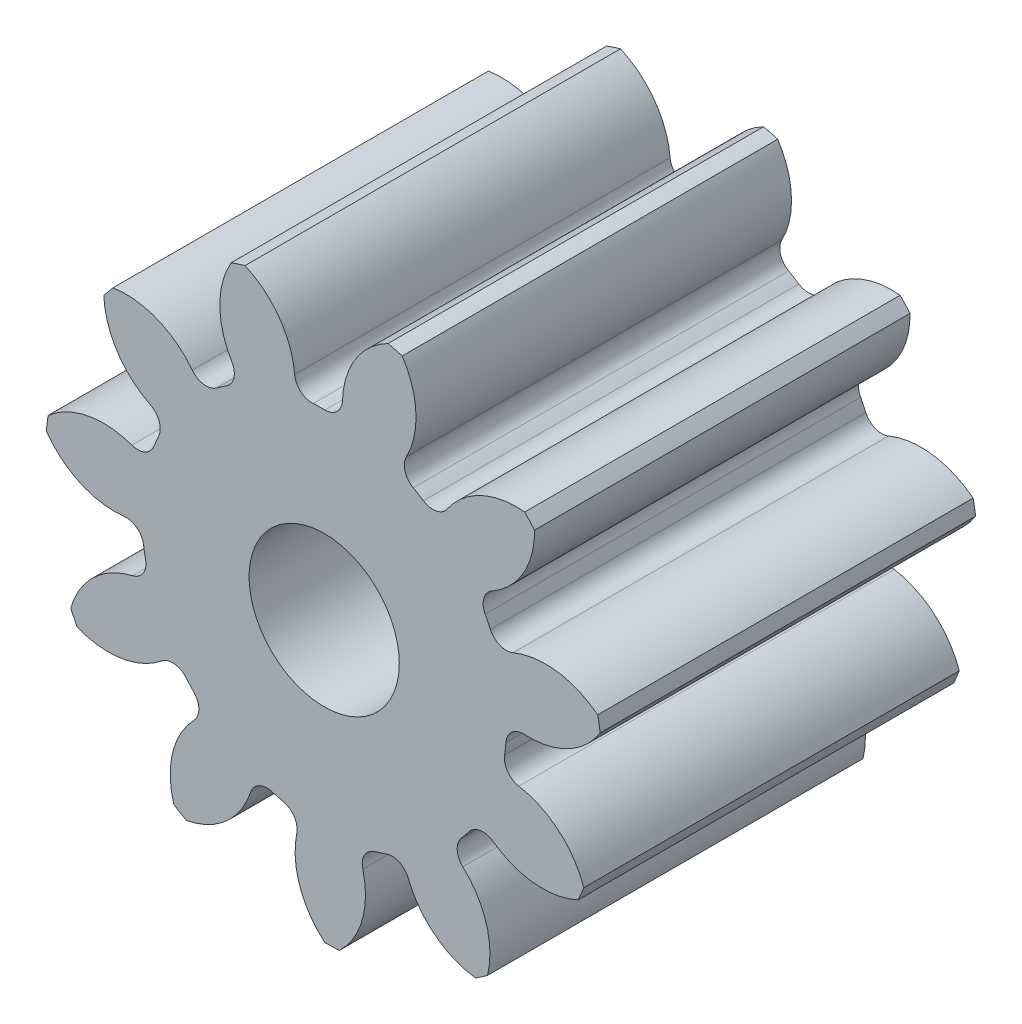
ISO-10303-21;
HEADER;
FILE_DESCRIPTION(('STEP AP214'),'2;1');
FILE_NAME('part.step','',(''),(''),'','','');
FILE_SCHEMA(('AUTOMOTIVE_DESIGN { 1 0 10303 214 1 1 1 1 }'));
ENDSEC;
DATA;
#1=APPLICATION_CONTEXT('core data for automotive mechanical design processes');
#2=APPLICATION_PROTOCOL_DEFINITION('international standard','automotive_design',2000,#1);
#3=PRODUCT_CONTEXT('',#1,'mechanical');
#4=PRODUCT('Part','Part','',(#3));
#5=PRODUCT_RELATED_PRODUCT_CATEGORY('part','',(#4));
#6=PRODUCT_DEFINITION_FORMATION('','',#4);
#7=PRODUCT_DEFINITION_CONTEXT('part definition',#1,'design');
#8=PRODUCT_DEFINITION('design','',#6,#7);
#9=PRODUCT_DEFINITION_SHAPE('','',#8);
#10=(LENGTH_UNIT() NAMED_UNIT(*) SI_UNIT(.MILLI.,.METRE.));
#11=(NAMED_UNIT(*) PLANE_ANGLE_UNIT() SI_UNIT($,.RADIAN.));
#12=(NAMED_UNIT(*) SI_UNIT($,.STERADIAN.) SOLID_ANGLE_UNIT());
#13=UNCERTAINTY_MEASURE_WITH_UNIT(LENGTH_MEASURE(1.E-05),#10,'distance_accuracy_value','');
#14=(GEOMETRIC_REPRESENTATION_CONTEXT(3) GLOBAL_UNCERTAINTY_ASSIGNED_CONTEXT((#13)) GLOBAL_UNIT_ASSIGNED_CONTEXT((#10,
#11,#12)) REPRESENTATION_CONTEXT('',''));
#15=CARTESIAN_POINT('',(0.,0.,0.));
#16=DIRECTION('',(0.,0.,1.));
#17=DIRECTION('',(1.,0.,0.));
#18=AXIS2_PLACEMENT_3D('',#15,#16,#17);
#19=CARTESIAN_POINT('',(0.,0.,88.9));
#20=DIRECTION('',(0.,0.,-1.));
#21=DIRECTION('',(-1.,0.,0.));
#22=AXIS2_PLACEMENT_3D('',#19,#20,#21);
#23=CYLINDRICAL_SURFACE('',#22,66.04);
#24=DIRECTION('',(0.,0.,-1.));
#25=VECTOR('',#24,1.);
#26=CARTESIAN_POINT('',(64.7589085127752,12.9447042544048,44.45));
#27=LINE('',#26,#25);
#28=CARTESIAN_POINT('',(64.7589085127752,12.9447042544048,88.9));
#29=VERTEX_POINT('',#28);
#30=CARTESIAN_POINT('',(64.7589085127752,12.9447042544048,0.));
#31=VERTEX_POINT('',#30);
#32=EDGE_CURVE('E492',#29,#31,#27,.T.);
#33=ORIENTED_EDGE('',*,*,#32,.F.);
#34=CARTESIAN_POINT('',(0.,0.,88.9));
#35=DIRECTION('',(0.,0.,1.));
#36=DIRECTION('',(1.,0.,0.));
#37=AXIS2_PLACEMENT_3D('',#34,#35,#36);
#38=CIRCLE('',#37,66.04);
#39=CARTESIAN_POINT('',(65.348369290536,9.53269275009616,88.9));
#40=VERTEX_POINT('',#39);
#41=EDGE_CURVE('E871',#40,#29,#38,.T.);
#42=ORIENTED_EDGE('',*,*,#41,.F.);
#43=DIRECTION('',(0.,0.,-1.));
#44=VECTOR('',#43,1.);
#45=CARTESIAN_POINT('',(65.348369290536,9.53269275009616,44.45));
#46=LINE('',#45,#44);
#47=CARTESIAN_POINT('',(65.348369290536,9.53269275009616,0.));
#48=VERTEX_POINT('',#47);
#49=EDGE_CURVE('E865',#48,#40,#46,.F.);
#50=ORIENTED_EDGE('',*,*,#49,.F.);
#51=CARTESIAN_POINT('',(0.,0.,0.));
#52=DIRECTION('',(0.,0.,1.));
#53=DIRECTION('',(1.,0.,0.));
#54=AXIS2_PLACEMENT_3D('',#51,#52,#53);
#55=CIRCLE('',#54,66.04);
#56=EDGE_CURVE('E876',#48,#31,#55,.T.);
#57=ORIENTED_EDGE('',*,*,#56,.T.);
#58=EDGE_LOOP('',(#33,#42,#50,#57));
#59=FACE_BOUND('',#58,.T.);
#60=ADVANCED_FACE('F33',(#59),#23,.T.);
#61=DIRECTION('',(0.,0.,-1.));
#62=VECTOR('',#61,1.);
#63=CARTESIAN_POINT('',(49.8207837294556,43.3494072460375,44.45));
#64=LINE('',#63,#62);
#65=CARTESIAN_POINT('',(49.8207837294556,43.3494072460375,0.));
#66=VERTEX_POINT('',#65);
#67=CARTESIAN_POINT('',(49.8207837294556,43.3494072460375,88.9));
#68=VERTEX_POINT('',#67);
#69=EDGE_CURVE('E463',#66,#68,#64,.F.);
#70=ORIENTED_EDGE('',*,*,#69,.F.);
#71=CARTESIAN_POINT('',(47.480225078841,45.901087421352,0.));
#72=VERTEX_POINT('',#71);
#73=EDGE_CURVE('E879',#66,#72,#55,.T.);
#74=ORIENTED_EDGE('',*,*,#73,.T.);
#75=DIRECTION('',(0.,0.,-1.));
#76=VECTOR('',#75,1.);
#77=CARTESIAN_POINT('',(47.480225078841,45.901087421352,44.45));
#78=LINE('',#77,#76);
#79=CARTESIAN_POINT('',(47.480225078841,45.901087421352,88.9));
#80=VERTEX_POINT('',#79);
#81=EDGE_CURVE('E525',#80,#72,#78,.T.);
#82=ORIENTED_EDGE('',*,*,#81,.F.);
#83=EDGE_CURVE('E874',#68,#80,#38,.T.);
#84=ORIENTED_EDGE('',*,*,#83,.F.);
#85=EDGE_LOOP('',(#70,#74,#82,#84));
#86=FACE_BOUND('',#85,.T.);
#87=ADVANCED_FACE('F1006',(#86),#23,.T.);
#88=CARTESIAN_POINT('',(0.,0.,88.9));
#89=DIRECTION('',(0.,0.,1.));
#90=DIRECTION('',(1.,0.,0.));
#91=AXIS2_PLACEMENT_3D('',#88,#89,#90);
#92=PLANE('',#91);
#93=CARTESIAN_POINT('',(0.,0.,88.9000000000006));
#94=DIRECTION('',(0.,0.,1.));
#95=DIRECTION('',(1.,0.,0.));
#96=AXIS2_PLACEMENT_3D('',#93,#94,#95);
#97=CIRCLE('',#96,17.78);
#98=CARTESIAN_POINT('',(17.78,0.,88.9000000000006));
#99=VERTEX_POINT('',#98);
#100=EDGE_CURVE('E480',#99,#99,#97,.T.);
#101=ORIENTED_EDGE('',*,*,#100,.F.);
#102=EDGE_LOOP('',(#101));
#103=FACE_BOUND('',#102,.T.);
#104=ORIENTED_EDGE('',*,*,#41,.T.);
#105=CARTESIAN_POINT('',(52.4429343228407,-2.65353034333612,88.9));
#106=DIRECTION('',(0.,0.,-1.));
#107=DIRECTION('',(0.841253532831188,0.540640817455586,0.));
#108=AXIS2_PLACEMENT_3D('',#105,#106,#107);
#109=CIRCLE('',#108,19.8743086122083);
#110=CARTESIAN_POINT('',(44.7275385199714,15.6620589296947,88.9));
#111=VERTEX_POINT('',#110);
#112=EDGE_CURVE('E472',#111,#29,#109,.T.);
#113=ORIENTED_EDGE('',*,*,#112,.F.);
#114=CARTESIAN_POINT('',(43.1222455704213,19.4728661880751,88.9));
#115=DIRECTION('',(0.,0.,1.));
#116=DIRECTION('',(-0.841253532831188,-0.540640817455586,0.));
#117=AXIS2_PLACEMENT_3D('',#114,#115,#116);
#118=CIRCLE('',#117,4.13512);
#119=CARTESIAN_POINT('',(39.3535631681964,17.7710288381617,88.9));
#120=VERTEX_POINT('',#119);
#121=EDGE_CURVE('E470',#120,#111,#118,.T.);
#122=ORIENTED_EDGE('',*,*,#121,.F.);
#123=CARTESIAN_POINT('',(0.,0.,88.9));
#124=DIRECTION('',(0.,0.,-1.));
#125=DIRECTION('',(0.841253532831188,0.540640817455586,0.));
#126=AXIS2_PLACEMENT_3D('',#123,#124,#125);
#127=CIRCLE('',#126,43.18);
#128=CARTESIAN_POINT('',(38.1157697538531,20.2904040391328,88.9));
#129=VERTEX_POINT('',#128);
#130=EDGE_CURVE('E455',#129,#120,#127,.T.);
#131=ORIENTED_EDGE('',*,*,#130,.F.);
#132=CARTESIAN_POINT('',(41.7659152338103,22.2335086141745,88.9));
#133=DIRECTION('',(0.,0.,1.));
#134=DIRECTION('',(-0.841253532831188,-0.540640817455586,0.));
#135=AXIS2_PLACEMENT_3D('',#132,#133,#134);
#136=CIRCLE('',#135,4.13512);
#137=CARTESIAN_POINT('',(39.7304680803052,25.8329769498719,88.9));
#138=VERTEX_POINT('',#137);
#139=EDGE_CURVE('E447',#138,#129,#136,.T.);
#140=ORIENTED_EDGE('',*,*,#139,.F.);
#141=CARTESIAN_POINT('',(29.9476552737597,43.1328242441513,88.9));
#142=DIRECTION('',(0.,0.,-1.));
#143=DIRECTION('',(-0.841253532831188,-0.540640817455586,0.));
#144=AXIS2_PLACEMENT_3D('',#141,#142,#143);
#145=CIRCLE('',#144,19.8743086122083);
#146=EDGE_CURVE('E477',#68,#138,#145,.T.);
#147=ORIENTED_EDGE('',*,*,#146,.F.);
#148=ORIENTED_EDGE('',*,*,#83,.T.);
#149=CARTESIAN_POINT('',(45.5524105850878,26.1204991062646,88.9));
#150=DIRECTION('',(0.,0.,-1.));
#151=DIRECTION('',(0.415415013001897,0.909631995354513,0.));
#152=AXIS2_PLACEMENT_3D('',#149,#150,#151);
#153=CIRCLE('',#152,19.8743086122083);
#154=CARTESIAN_POINT('',(29.1596514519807,37.35729539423,88.9));
#155=VERTEX_POINT('',#154);
#156=EDGE_CURVE('E501',#155,#80,#153,.T.);
#157=ORIENTED_EDGE('',*,*,#156,.F.);
#158=CARTESIAN_POINT('',(25.7489151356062,39.6952635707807,88.9));
#159=DIRECTION('',(0.,0.,1.));
#160=DIRECTION('',(-0.415415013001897,-0.909631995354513,0.));
#161=AXIS2_PLACEMENT_3D('',#158,#159,#160);
#162=CIRCLE('',#161,4.13512);
#163=CARTESIAN_POINT('',(23.4985804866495,36.2260833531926,88.9));
#164=VERTEX_POINT('',#163);
#165=EDGE_CURVE('E499',#164,#155,#162,.T.);
#166=ORIENTED_EDGE('',*,*,#165,.F.);
#167=CARTESIAN_POINT('',(0.,0.,88.9));
#168=DIRECTION('',(0.,0.,-1.));
#169=DIRECTION('',(0.415415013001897,0.909631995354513,0.));
#170=AXIS2_PLACEMENT_3D('',#167,#168,#169);
#171=CIRCLE('',#170,43.18);
#172=CARTESIAN_POINT('',(21.0952053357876,37.6763149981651,88.9));
#173=VERTEX_POINT('',#172);
#174=EDGE_CURVE('E496',#173,#164,#171,.T.);
#175=ORIENTED_EDGE('',*,*,#174,.F.);
#176=CARTESIAN_POINT('',(23.1153814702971,41.2843762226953,88.9));
#177=DIRECTION('',(0.,0.,1.));
#178=DIRECTION('',(-0.415415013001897,-0.909631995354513,0.));
#179=AXIS2_PLACEMENT_3D('',#176,#177,#178);
#180=CIRCLE('',#179,4.13512);
#181=CARTESIAN_POINT('',(19.4570348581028,43.2119958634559,88.9));
#182=VERTEX_POINT('',#181);
#183=EDGE_CURVE('E494',#182,#173,#180,.T.);
#184=ORIENTED_EDGE('',*,*,#183,.F.);
#185=CARTESIAN_POINT('',(1.87420544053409,52.4765656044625,88.9));
#186=DIRECTION('',(0.,0.,-1.));
#187=DIRECTION('',(-0.415415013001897,-0.909631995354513,0.));
#188=AXIS2_PLACEMENT_3D('',#185,#186,#187);
#189=CIRCLE('',#188,19.8743086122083);
#190=CARTESIAN_POINT('',(18.4754513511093,63.4029912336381,88.9));
#191=VERTEX_POINT('',#190);
#192=EDGE_CURVE('E504',#191,#182,#189,.T.);
#193=ORIENTED_EDGE('',*,*,#192,.F.);
#194=CARTESIAN_POINT('',(15.1269056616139,64.2841996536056,88.9));
#195=VERTEX_POINT('',#194);
#196=EDGE_CURVE('E909',#191,#195,#38,.T.);
#197=ORIENTED_EDGE('',*,*,#196,.T.);
#198=CARTESIAN_POINT('',(24.1993183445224,46.6014546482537,88.9));
#199=DIRECTION('',(0.,0.,-1.));
#200=DIRECTION('',(-0.142314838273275,0.989821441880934,0.));
#201=AXIS2_PLACEMENT_3D('',#198,#199,#200);
#202=CIRCLE('',#201,19.8743086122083);
#203=CARTESIAN_POINT('',(4.3337810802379,47.1918545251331,88.9));
#204=VERTEX_POINT('',#203);
#205=EDGE_CURVE('E536',#204,#195,#202,.T.);
#206=ORIENTED_EDGE('',*,*,#205,.F.);
#207=CARTESIAN_POINT('',(0.200486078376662,47.3146952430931,88.9));
#208=DIRECTION('',(0.,0.,1.));
#209=DIRECTION('',(0.142314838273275,-0.989821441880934,0.));
#210=AXIS2_PLACEMENT_3D('',#207,#208,#209);
#211=CIRCLE('',#210,4.13512);
#212=CARTESIAN_POINT('',(0.182964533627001,43.1796123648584,88.9));
#213=VERTEX_POINT('',#212);
#214=EDGE_CURVE('E534',#213,#204,#211,.T.);
#215=ORIENTED_EDGE('',*,*,#214,.F.);
#216=CARTESIAN_POINT('',(0.,0.,88.9));
#217=DIRECTION('',(0.,0.,-1.));
#218=DIRECTION('',(-0.142314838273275,0.989821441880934,0.));
#219=AXIS2_PLACEMENT_3D('',#216,#217,#218);
#220=CIRCLE('',#219,43.18);
#221=CARTESIAN_POINT('',(-2.62293772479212,43.1002621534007,88.9));
#222=VERTEX_POINT('',#221);
#223=EDGE_CURVE('E531',#222,#213,#220,.T.);
#224=ORIENTED_EDGE('',*,*,#223,.F.);
#225=CARTESIAN_POINT('',(-2.87412258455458,47.2277460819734,88.9));
#226=DIRECTION('',(0.,0.,1.));
#227=DIRECTION('',(0.142314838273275,-0.989821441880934,0.));
#228=AXIS2_PLACEMENT_3D('',#225,#226,#227);
#229=CIRCLE('',#228,4.13512);
#230=CARTESIAN_POINT('',(-6.99386945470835,46.8715114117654,88.9));
#231=VERTEX_POINT('',#230);
#232=EDGE_CURVE('E529',#231,#222,#229,.T.);
#233=ORIENTED_EDGE('',*,*,#232,.F.);
#234=CARTESIAN_POINT('',(-26.7942913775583,45.1593681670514,88.9));
#235=DIRECTION('',(0.,0.,-1.));
#236=DIRECTION('',(0.142314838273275,-0.989821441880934,0.));
#237=AXIS2_PLACEMENT_3D('',#234,#235,#236);
#238=CIRCLE('',#237,19.8743086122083);
#239=CARTESIAN_POINT('',(-18.735706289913,63.3265734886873,88.9));
#240=VERTEX_POINT('',#239);
#241=EDGE_CURVE('E539',#240,#231,#238,.T.);
#242=ORIENTED_EDGE('',*,*,#241,.F.);
#243=CARTESIAN_POINT('',(-22.0290994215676,62.2575327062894,88.9));
#244=VERTEX_POINT('',#243);
#245=EDGE_CURVE('E988',#240,#244,#38,.T.);
#246=ORIENTED_EDGE('',*,*,#245,.T.);
#247=CARTESIAN_POINT('',(-4.83688648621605,52.2867776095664,88.9));
#248=DIRECTION('',(0.,0.,-1.));
#249=DIRECTION('',(-0.654860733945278,0.755749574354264,0.));
#250=AXIS2_PLACEMENT_3D('',#247,#248,#249);
#251=CIRCLE('',#250,19.8743086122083);
#252=CARTESIAN_POINT('',(-21.8680341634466,42.0433332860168,88.9));
#253=VERTEX_POINT('',#252);
#254=EDGE_CURVE('E574',#253,#244,#251,.T.);
#255=ORIENTED_EDGE('',*,*,#254,.F.);
#256=CARTESIAN_POINT('',(-25.4115958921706,39.9120454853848,88.9));
#257=DIRECTION('',(0.,0.,1.));
#258=DIRECTION('',(0.654860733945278,-0.755749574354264,0.));
#259=AXIS2_PLACEMENT_3D('',#256,#257,#258);
#260=CIRCLE('',#259,4.13512);
#261=CARTESIAN_POINT('',(-23.1907413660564,36.4239195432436,88.9));
#262=VERTEX_POINT('',#261);
#263=EDGE_CURVE('E572',#262,#253,#260,.T.);
#264=ORIENTED_EDGE('',*,*,#263,.F.);
#265=CARTESIAN_POINT('',(0.,0.,88.9));
#266=DIRECTION('',(0.,0.,-1.));
#267=DIRECTION('',(-0.654860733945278,0.755749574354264,0.));
#268=AXIS2_PLACEMENT_3D('',#265,#266,#267);
#269=CIRCLE('',#268,43.18);
#270=CARTESIAN_POINT('',(-25.5083165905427,34.8401806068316,88.9));
#271=VERTEX_POINT('',#270);
#272=EDGE_CURVE('E569',#271,#262,#269,.T.);
#273=ORIENTED_EDGE('',*,*,#272,.F.);
#274=CARTESIAN_POINT('',(-27.95111302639,38.1766402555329,88.9));
#275=DIRECTION('',(0.,0.,1.));
#276=DIRECTION('',(0.654860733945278,-0.755749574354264,0.));
#277=AXIS2_PLACEMENT_3D('',#274,#275,#276);
#278=CIRCLE('',#277,4.13512);
#279=CARTESIAN_POINT('',(-31.2242696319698,35.6496532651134,88.9));
#280=VERTEX_POINT('',#279);
#281=EDGE_CURVE('E567',#280,#271,#278,.T.);
#282=ORIENTED_EDGE('',*,*,#281,.F.);
#283=CARTESIAN_POINT('',(-46.9557900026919,23.5043904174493,88.9));
#284=DIRECTION('',(0.,0.,-1.));
#285=DIRECTION('',(0.654860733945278,-0.755749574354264,0.));
#286=AXIS2_PLACEMENT_3D('',#283,#284,#285);
#287=CIRCLE('',#286,19.8743086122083);
#288=CARTESIAN_POINT('',(-49.9984095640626,43.144416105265,88.9));
#289=VERTEX_POINT('',#288);
#290=EDGE_CURVE('E577',#289,#280,#287,.T.);
#291=ORIENTED_EDGE('',*,*,#290,.F.);
#292=CARTESIAN_POINT('',(-52.19102108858,40.4645390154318,88.9));
#293=VERTEX_POINT('',#292);
#294=EDGE_CURVE('E984',#289,#293,#38,.T.);
#295=ORIENTED_EDGE('',*,*,#294,.T.);
#296=CARTESIAN_POINT('',(-32.3374140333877,41.3714181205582,88.9));
#297=DIRECTION('',(0.,0.,-1.));
#298=DIRECTION('',(-0.959492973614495,0.281732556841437,0.));
#299=AXIS2_PLACEMENT_3D('',#296,#297,#298);
#300=CIRCLE('',#299,19.8743086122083);
#301=CARTESIAN_POINT('',(-41.1269030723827,23.5463507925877,88.9));
#302=VERTEX_POINT('',#301);
#303=EDGE_CURVE('E612',#302,#293,#300,.T.);
#304=ORIENTED_EDGE('',*,*,#303,.F.);
#305=CARTESIAN_POINT('',(-42.9556757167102,19.8376032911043,88.9));
#306=DIRECTION('',(0.,0.,1.));
#307=DIRECTION('',(0.959492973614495,-0.281732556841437,0.));
#308=AXIS2_PLACEMENT_3D('',#305,#306,#307);
#309=CIRCLE('',#308,4.13512);
#310=CARTESIAN_POINT('',(-39.2015507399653,18.1038896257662,88.9));
#311=VERTEX_POINT('',#310);
#312=EDGE_CURVE('E610',#311,#302,#309,.T.);
#313=ORIENTED_EDGE('',*,*,#312,.F.);
#314=CARTESIAN_POINT('',(0.,0.,88.9));
#315=DIRECTION('',(0.,0.,-1.));
#316=DIRECTION('',(-0.959492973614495,0.281732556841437,0.));
#317=AXIS2_PLACEMENT_3D('',#314,#315,#316);
#318=CIRCLE('',#317,43.18);
#319=CARTESIAN_POINT('',(-40.2949851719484,15.5185878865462,88.9));
#320=VERTEX_POINT('',#319);
#321=EDGE_CURVE('E607',#320,#311,#318,.T.);
#322=ORIENTED_EDGE('',*,*,#321,.F.);
#323=CARTESIAN_POINT('',(-44.1538225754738,17.0047208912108,88.9));
#324=DIRECTION('',(0.,0.,1.));
#325=DIRECTION('',(0.959492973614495,-0.281732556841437,0.));
#326=AXIS2_PLACEMENT_3D('',#323,#324,#325);
#327=CIRCLE('',#326,4.13512);
#328=CARTESIAN_POINT('',(-45.5411848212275,13.1092820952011,88.9));
#329=VERTEX_POINT('',#328);
#330=EDGE_CURVE('E605',#329,#320,#327,.T.);
#331=ORIENTED_EDGE('',*,*,#330,.F.);
#332=CARTESIAN_POINT('',(-52.209157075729,-5.61306521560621,88.9));
#333=DIRECTION('',(0.,0.,-1.));
#334=DIRECTION('',(0.959492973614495,-0.281732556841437,0.));
#335=AXIS2_PLACEMENT_3D('',#332,#333,#334);
#336=CIRCLE('',#335,19.8743086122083);
#337=CARTESIAN_POINT('',(-65.3869710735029,9.26421145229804,88.9));
#338=VERTEX_POINT('',#337);
#339=EDGE_CURVE('E615',#338,#329,#336,.T.);
#340=ORIENTED_EDGE('',*,*,#339,.F.);
#341=CARTESIAN_POINT('',(-65.7826623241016,5.82434009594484,88.9));
#342=VERTEX_POINT('',#341);
#343=EDGE_CURVE('E980',#338,#342,#38,.T.);
#344=ORIENTED_EDGE('',*,*,#343,.T.);
#345=CARTESIAN_POINT('',(-49.5710411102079,17.3209256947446,88.9));
#346=DIRECTION('',(0.,0.,-1.));
#347=DIRECTION('',(-0.959492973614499,-0.281732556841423,0.));
#348=AXIS2_PLACEMENT_3D('',#345,#346,#347);
#349=CIRCLE('',#348,19.8743086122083);
#350=CARTESIAN_POINT('',(-47.3282708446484,-2.42643170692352,88.9));
#351=VERTEX_POINT('',#350);
#352=EDGE_CURVE('E650',#351,#342,#349,.T.);
#353=ORIENTED_EDGE('',*,*,#352,.F.);
#354=CARTESIAN_POINT('',(-46.8616320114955,-6.53513778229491,88.9));
#355=DIRECTION('',(0.,0.,1.));
#356=DIRECTION('',(0.959492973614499,0.281732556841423,0.));
#357=AXIS2_PLACEMENT_3D('',#354,#355,#356);
#358=CIRCLE('',#357,4.13512);
#359=CARTESIAN_POINT('',(-42.7661447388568,-5.96399733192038,88.9));
#360=VERTEX_POINT('',#359);
#361=EDGE_CURVE('E648',#360,#351,#358,.T.);
#362=ORIENTED_EDGE('',*,*,#361,.F.);
#363=CARTESIAN_POINT('',(0.,0.,88.9));
#364=DIRECTION('',(0.,0.,-1.));
#365=DIRECTION('',(-0.959492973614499,-0.281732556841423,0.));
#366=AXIS2_PLACEMENT_3D('',#363,#364,#365);
#367=CIRCLE('',#366,43.18);
#368=CARTESIAN_POINT('',(-42.2882806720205,-8.7300468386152,88.9));
#369=VERTEX_POINT('',#368);
#370=EDGE_CURVE('E645',#369,#360,#367,.T.);
#371=ORIENTED_EDGE('',*,*,#370,.F.);
#372=CARTESIAN_POINT('',(-46.338005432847,-9.56607720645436,88.9));
#373=DIRECTION('',(0.,0.,1.));
#374=DIRECTION('',(0.959492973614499,0.281732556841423,0.));
#375=AXIS2_PLACEMENT_3D('',#372,#373,#374);
#376=CIRCLE('',#375,4.13512);
#377=CARTESIAN_POINT('',(-45.3990956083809,-13.5931935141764,88.9));
#378=VERTEX_POINT('',#377);
#379=EDGE_CURVE('E643',#378,#369,#376,.T.);
#380=ORIENTED_EDGE('',*,*,#379,.F.);
#381=CARTESIAN_POINT('',(-40.8864856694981,-32.9484123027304,88.9));
#382=DIRECTION('',(0.,0.,-1.));
#383=DIRECTION('',(0.959492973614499,0.281732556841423,0.));
#384=AXIS2_PLACEMENT_3D('',#381,#382,#383);
#385=CIRCLE('',#384,19.8743086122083);
#386=CARTESIAN_POINT('',(-60.0156312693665,-27.5573148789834,88.9));
#387=VERTEX_POINT('',#386);
#388=EDGE_CURVE('E653',#387,#378,#385,.T.);
#389=ORIENTED_EDGE('',*,*,#388,.F.);
#390=CARTESIAN_POINT('',(-58.4887730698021,-30.665045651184,88.9));
#391=VERTEX_POINT('',#390);
#392=EDGE_CURVE('E976',#387,#391,#38,.T.);
#393=ORIENTED_EDGE('',*,*,#392,.T.);
#394=CARTESIAN_POINT('',(-51.0662128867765,-12.2288382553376,88.9));
#395=DIRECTION('',(0.,0.,-1.));
#396=DIRECTION('',(-0.654860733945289,-0.755749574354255,0.));
#397=AXIS2_PLACEMENT_3D('',#394,#395,#396);
#398=CIRCLE('',#397,19.8743086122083);
#399=CARTESIAN_POINT('',(-38.5032470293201,-27.6288392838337,88.9));
#400=VERTEX_POINT('',#399);
#401=EDGE_CURVE('E688',#400,#391,#398,.T.);
#402=ORIENTED_EDGE('',*,*,#401,.F.);
#403=CARTESIAN_POINT('',(-35.8893512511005,-30.8330187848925,88.9));
#404=DIRECTION('',(0.,0.,1.));
#405=DIRECTION('',(0.654860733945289,0.755749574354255,0.));
#406=AXIS2_PLACEMENT_3D('',#403,#404,#405);
#407=CIRCLE('',#406,4.13512);
#408=CARTESIAN_POINT('',(-32.7527899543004,-28.1383572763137,88.9));
#409=VERTEX_POINT('',#408);
#410=EDGE_CURVE('E686',#409,#400,#407,.T.);
#411=ORIENTED_EDGE('',*,*,#410,.F.);
#412=CARTESIAN_POINT('',(0.,0.,88.9));
#413=DIRECTION('',(0.,0.,-1.));
#414=DIRECTION('',(-0.654860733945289,-0.755749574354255,0.));
#415=AXIS2_PLACEMENT_3D('',#412,#413,#414);
#416=CIRCLE('',#415,43.18);
#417=CARTESIAN_POINT('',(-30.8553458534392,-30.2069533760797,88.9));
#418=VERTEX_POINT('',#417);
#419=EDGE_CURVE('E683',#418,#409,#416,.T.);
#420=ORIENTED_EDGE('',*,*,#419,.F.);
#421=CARTESIAN_POINT('',(-33.8101989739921,-33.0997133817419,88.9));
#422=DIRECTION('',(0.,0.,1.));
#423=DIRECTION('',(0.654860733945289,0.755749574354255,0.));
#424=AXIS2_PLACEMENT_3D('',#421,#422,#423);
#425=CIRCLE('',#424,4.13512);
#426=CARTESIAN_POINT('',(-30.8431143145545,-35.9799262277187,88.9));
#427=VERTEX_POINT('',#426);
#428=EDGE_CURVE('E681',#427,#418,#425,.T.);
#429=ORIENTED_EDGE('',*,*,#428,.F.);
#430=CARTESIAN_POINT('',(-16.5826439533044,-49.8228712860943,88.9));
#431=DIRECTION('',(0.,0.,-1.));
#432=DIRECTION('',(0.654860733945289,0.755749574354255,0.));
#433=AXIS2_PLACEMENT_3D('',#430,#431,#432);
#434=CIRCLE('',#433,19.8743086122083);
#435=CARTESIAN_POINT('',(-35.5897525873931,-55.6295884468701,88.9));
#436=VERTEX_POINT('',#435);
#437=EDGE_CURVE('E691',#436,#427,#434,.T.);
#438=ORIENTED_EDGE('',*,*,#437,.F.);
#439=CARTESIAN_POINT('',(-32.6251116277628,-57.4184960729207,88.9));
#440=VERTEX_POINT('',#439);
#441=EDGE_CURVE('E972',#436,#440,#38,.T.);
#442=ORIENTED_EDGE('',*,*,#441,.T.);
#443=CARTESIAN_POINT('',(-36.3482228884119,-37.8960324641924,88.9));
#444=DIRECTION('',(0.,0.,-1.));
#445=DIRECTION('',(-0.142314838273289,-0.989821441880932,0.));
#446=AXIS2_PLACEMENT_3D('',#443,#444,#445);
#447=CIRCLE('',#446,19.8743086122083);
#448=CARTESIAN_POINT('',(-17.453714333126,-44.0592856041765,88.9));
#449=VERTEX_POINT('',#448);
#450=EDGE_CURVE('E726',#449,#440,#447,.T.);
#451=ORIENTED_EDGE('',*,*,#450,.F.);
#452=CARTESIAN_POINT('',(-13.5224550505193,-45.3416341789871,88.9));
#453=DIRECTION('',(0.,0.,1.));
#454=DIRECTION('',(0.142314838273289,0.989821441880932,0.));
#455=AXIS2_PLACEMENT_3D('',#452,#453,#454);
#456=CIRCLE('',#455,4.13512);
#457=CARTESIAN_POINT('',(-12.3406557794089,-41.3789876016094,88.9));
#458=VERTEX_POINT('',#457);
#459=EDGE_CURVE('E724',#458,#449,#456,.T.);
#460=ORIENTED_EDGE('',*,*,#459,.F.);
#461=CARTESIAN_POINT('',(0.,0.,88.9));
#462=DIRECTION('',(0.,0.,-1.));
#463=DIRECTION('',(-0.142314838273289,-0.989821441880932,0.));
#464=AXIS2_PLACEMENT_3D('',#461,#462,#463);
#465=CIRCLE('',#464,43.18);
#466=CARTESIAN_POINT('',(-9.62605673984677,-42.0933656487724,88.9));
#467=VERTEX_POINT('',#466);
#468=EDGE_CURVE('E721',#467,#458,#465,.T.);
#469=ORIENTED_EDGE('',*,*,#468,.F.);
#470=CARTESIAN_POINT('',(-10.547893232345,-46.1244244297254,88.9));
#471=DIRECTION('',(0.,0.,1.));
#472=DIRECTION('',(0.142314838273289,0.989821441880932,0.));
#473=AXIS2_PLACEMENT_3D('',#470,#471,#472);
#474=CIRCLE('',#473,4.13512);
#475=CARTESIAN_POINT('',(-6.49466215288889,-46.9432865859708,88.9));
#476=VERTEX_POINT('',#475);
#477=EDGE_CURVE('E719',#476,#467,#474,.T.);
#478=ORIENTED_EDGE('',*,*,#477,.F.);
#479=CARTESIAN_POINT('',(12.9860700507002,-50.8789206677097,88.9));
#480=DIRECTION('',(0.,0.,-1.));
#481=DIRECTION('',(0.142314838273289,0.989821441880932,0.));
#482=AXIS2_PLACEMENT_3D('',#479,#480,#481);
#483=CIRCLE('',#482,19.8743086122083);
#484=CARTESIAN_POINT('',(0.135621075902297,-66.0398607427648,88.9));
#485=VERTEX_POINT('',#484);
#486=EDGE_CURVE('E729',#485,#476,#483,.T.);
#487=ORIENTED_EDGE('',*,*,#486,.F.);
#488=CARTESIAN_POINT('',(3.59679223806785,-65.9419796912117,88.9));
#489=VERTEX_POINT('',#488);
#490=EDGE_CURVE('E968',#485,#489,#38,.T.);
#491=ORIENTED_EDGE('',*,*,#490,.T.);
#492=CARTESIAN_POINT('',(-10.0899289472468,-51.5315041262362,88.9));
#493=DIRECTION('',(0.,0.,-1.));
#494=DIRECTION('',(0.415415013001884,-0.909631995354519,0.));
#495=AXIS2_PLACEMENT_3D('',#492,#493,#494);
#496=CIRCLE('',#495,19.8743086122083);
#497=CARTESIAN_POINT('',(9.13724934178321,-46.5012200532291,88.9));
#498=VERTEX_POINT('',#497);
#499=EDGE_CURVE('E764',#498,#489,#496,.T.);
#500=ORIENTED_EDGE('',*,*,#499,.F.);
#501=CARTESIAN_POINT('',(13.1377250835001,-45.4546010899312,88.9));
#502=DIRECTION('',(0.,0.,1.));
#503=DIRECTION('',(-0.415415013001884,0.909631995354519,0.));
#504=AXIS2_PLACEMENT_3D('',#501,#502,#503);
#505=CIRCLE('',#504,4.13512);
#506=CARTESIAN_POINT('',(11.9895494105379,-41.4820817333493,88.9));
#507=VERTEX_POINT('',#506);
#508=EDGE_CURVE('E762',#507,#498,#505,.T.);
#509=ORIENTED_EDGE('',*,*,#508,.F.);
#510=CARTESIAN_POINT('',(0.,0.,88.9));
#511=DIRECTION('',(0.,0.,-1.));
#512=DIRECTION('',(0.415415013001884,-0.909631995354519,0.));
#513=AXIS2_PLACEMENT_3D('',#510,#511,#512);
#514=CIRCLE('',#513,43.18);
#515=CARTESIAN_POINT('',(14.6594373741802,-40.6154317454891,88.9));
#516=VERTEX_POINT('',#515);
#517=EDGE_CURVE('E759',#516,#507,#514,.T.);
#518=ORIENTED_EDGE('',*,*,#517,.F.);
#519=CARTESIAN_POINT('',(16.0632940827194,-44.5049566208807,88.9));
#520=DIRECTION('',(0.,0.,1.));
#521=DIRECTION('',(-0.415415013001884,0.909631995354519,0.));
#522=AXIS2_PLACEMENT_3D('',#519,#520,#521);
#523=CIRCLE('',#522,4.13512);
#524=CARTESIAN_POINT('',(19.915799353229,-43.0024851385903,88.9));
#525=VERTEX_POINT('',#524);
#526=EDGE_CURVE('E757',#525,#516,#523,.T.);
#527=ORIENTED_EDGE('',*,*,#526,.F.);
#528=CARTESIAN_POINT('',(38.4317985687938,-35.781272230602,88.9));
#529=DIRECTION('',(0.,0.,-1.));
#530=DIRECTION('',(-0.415415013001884,0.909631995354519,0.));
#531=AXIS2_PLACEMENT_3D('',#528,#529,#530);
#532=CIRCLE('',#531,19.8743086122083);
#533=CARTESIAN_POINT('',(35.8179360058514,-55.4829438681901,88.9));
#534=VERTEX_POINT('',#533);
#535=EDGE_CURVE('E767',#534,#525,#532,.T.);
#536=ORIENTED_EDGE('',*,*,#535,.F.);
#537=CARTESIAN_POINT('',(38.6767399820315,-53.5293506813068,88.9));
#538=VERTEX_POINT('',#537);
#539=EDGE_CURVE('E967',#534,#538,#38,.T.);
#540=ORIENTED_EDGE('',*,*,#539,.T.);
#541=CARTESIAN_POINT('',(19.371846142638,-48.8060873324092,88.9));
#542=DIRECTION('',(0.,0.,-1.));
#543=DIRECTION('',(0.841253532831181,-0.540640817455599,0.));
#544=AXIS2_PLACEMENT_3D('',#541,#542,#543);
#545=CIRCLE('',#544,19.8743086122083);
#546=CARTESIAN_POINT('',(32.827200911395,-34.1793456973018,88.9));
#547=VERTEX_POINT('',#546);
#548=EDGE_CURVE('E802',#547,#538,#545,.T.);
#549=ORIENTED_EDGE('',*,*,#548,.F.);
#550=CARTESIAN_POINT('',(35.6267703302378,-31.1360533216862,88.9));
#551=DIRECTION('',(0.,0.,1.));
#552=DIRECTION('',(-0.841253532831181,0.540640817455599,0.));
#553=AXIS2_PLACEMENT_3D('',#550,#551,#552);
#554=CIRCLE('',#553,4.13512);
#555=CARTESIAN_POINT('',(32.513157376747,-28.4149080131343,88.9));
#556=VERTEX_POINT('',#555);
#557=EDGE_CURVE('E800',#556,#547,#554,.T.);
#558=ORIENTED_EDGE('',*,*,#557,.F.);
#559=CARTESIAN_POINT('',(0.,0.,88.9));
#560=DIRECTION('',(0.,0.,-1.));
#561=DIRECTION('',(0.841253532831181,-0.540640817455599,0.));
#562=AXIS2_PLACEMENT_3D('',#559,#560,#561);
#563=CIRCLE('',#562,43.18);
#564=CARTESIAN_POINT('',(34.2906637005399,-26.2423852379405,88.9));
#565=VERTEX_POINT('',#564);
#566=EDGE_CURVE('E797',#565,#556,#563,.T.);
#567=ORIENTED_EDGE('',*,*,#566,.F.);
#568=CARTESIAN_POINT('',(37.5744990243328,-28.7554795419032,88.9));
#569=DIRECTION('',(0.,0.,1.));
#570=DIRECTION('',(-0.841253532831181,0.540640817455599,0.));
#571=AXIS2_PLACEMENT_3D('',#568,#569,#570);
#572=CIRCLE('',#571,4.13512);
#573=CARTESIAN_POINT('',(40.0031352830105,-25.408698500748,88.9));
#574=VERTEX_POINT('',#573);
#575=EDGE_CURVE('E795',#574,#565,#572,.T.);
#576=ORIENTED_EDGE('',*,*,#575,.F.);
#577=CARTESIAN_POINT('',(51.6757025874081,-9.32332267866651,88.9));
#578=DIRECTION('',(0.,0.,-1.));
#579=DIRECTION('',(-0.841253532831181,0.540640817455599,0.));
#580=AXIS2_PLACEMENT_3D('',#577,#578,#579);
#581=CIRCLE('',#580,19.8743086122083);
#582=CARTESIAN_POINT('',(60.128309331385,-27.3105843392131,88.9));
#583=VERTEX_POINT('',#582);
#584=EDGE_CURVE('E805',#583,#574,#581,.T.);
#585=ORIENTED_EDGE('',*,*,#584,.F.);
#586=CARTESIAN_POINT('',(61.4770960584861,-24.1215310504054,88.9));
#587=VERTEX_POINT('',#586);
#588=EDGE_CURVE('E875',#583,#587,#38,.T.);
#589=ORIENTED_EDGE('',*,*,#588,.T.);
#590=CARTESIAN_POINT('',(42.6831969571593,-30.5850826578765,88.9));
#591=DIRECTION('',(0.,0.,-1.));
#592=DIRECTION('',(1.,0.,0.));
#593=AXIS2_PLACEMENT_3D('',#590,#591,#592);
#594=CIRCLE('',#593,19.8743086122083);
#595=CARTESIAN_POINT('',(46.0947481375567,-11.0057705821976,88.9));
#596=VERTEX_POINT('',#595);
#597=EDGE_CURVE('E840',#596,#587,#594,.T.);
#598=ORIENTED_EDGE('',*,*,#597,.F.);
#599=CARTESIAN_POINT('',(46.8045677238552,-6.93202862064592,88.9));
#600=DIRECTION('',(0.,0.,1.));
#601=DIRECTION('',(-1.,0.,0.));
#602=AXIS2_PLACEMENT_3D('',#599,#600,#601);
#603=CIRCLE('',#602,4.13512);
#604=CARTESIAN_POINT('',(42.7140676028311,-6.32620176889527,88.9));
#605=VERTEX_POINT('',#604);
#606=EDGE_CURVE('E838',#605,#596,#603,.T.);
#607=ORIENTED_EDGE('',*,*,#606,.F.);
#608=CARTESIAN_POINT('',(0.,0.,88.9));
#609=DIRECTION('',(0.,0.,-1.));
#610=DIRECTION('',(1.,0.,0.));
#611=AXIS2_PLACEMENT_3D('',#608,#609,#610);
#612=CIRCLE('',#611,43.18);
#613=CARTESIAN_POINT('',(43.03484658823,-3.53756683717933,88.9));
#614=VERTEX_POINT('',#613);
#615=EDGE_CURVE('E835',#614,#605,#612,.T.);
#616=ORIENTED_EDGE('',*,*,#615,.F.);
#617=CARTESIAN_POINT('',(47.156066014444,-3.87634088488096,88.9));
#618=DIRECTION('',(0.,0.,1.));
#619=DIRECTION('',(-1.,0.,0.));
#620=AXIS2_PLACEMENT_3D('',#617,#618,#619);
#621=CIRCLE('',#620,4.13512);
#622=CARTESIAN_POINT('',(47.3897584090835,0.2521703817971,88.9));
#623=VERTEX_POINT('',#622);
#624=EDGE_CURVE('E833',#623,#614,#621,.T.);
#625=ORIENTED_EDGE('',*,*,#624,.F.);
#626=CARTESIAN_POINT('',(48.512936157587,20.0947159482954,88.9));
#627=DIRECTION('',(0.,0.,-1.));
#628=DIRECTION('',(-1.,0.,0.));
#629=AXIS2_PLACEMENT_3D('',#626,#627,#628);
#630=CIRCLE('',#629,19.8743086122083);
#631=EDGE_CURVE('E843',#40,#623,#630,.T.);
#632=ORIENTED_EDGE('',*,*,#631,.F.);
#633=EDGE_LOOP('',(#104,#113,#122,#131,#140,#147,#148,#157,#166,#175,#184,#193,#197,#206,#215,
#224,#233,#242,#246,#255,#264,#273,#282,#291,#295,#304,#313,#322,#331,#340,#344,#353,#362,#371,
#380,#389,#393,#402,#411,#420,#429,#438,#442,#451,#460,#469,#478,#487,#491,#500,#509,#518,#527,
#536,#540,#549,#558,#567,#576,#585,#589,#598,#607,#616,#625,#632));
#634=FACE_BOUND('',#633,.T.);
#635=ADVANCED_FACE('F468',(#103,#634),#92,.T.);
#636=CARTESIAN_POINT('',(0.,0.,0.));
#637=DIRECTION('',(0.,0.,1.));
#638=DIRECTION('',(1.,0.,0.));
#639=AXIS2_PLACEMENT_3D('',#636,#637,#638);
#640=PLANE('',#639);
#641=CARTESIAN_POINT('',(0.,0.,0.));
#642=DIRECTION('',(0.,0.,1.));
#643=DIRECTION('',(1.,0.,0.));
#644=AXIS2_PLACEMENT_3D('',#641,#642,#643);
#645=CIRCLE('',#644,17.78);
#646=CARTESIAN_POINT('',(17.78,0.,-1.77635683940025E-12));
#647=VERTEX_POINT('',#646);
#648=EDGE_CURVE('E36',#647,#647,#645,.T.);
#649=ORIENTED_EDGE('',*,*,#648,.T.);
#650=EDGE_LOOP('',(#649));
#651=FACE_BOUND('',#650,.T.);
#652=CARTESIAN_POINT('',(52.4429343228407,-2.65353034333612,0.));
#653=DIRECTION('',(0.,0.,-1.));
#654=DIRECTION('',(0.841253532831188,0.540640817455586,0.));
#655=AXIS2_PLACEMENT_3D('',#652,#653,#654);
#656=CIRCLE('',#655,19.8743086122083);
#657=CARTESIAN_POINT('',(44.7275385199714,15.6620589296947,0.));
#658=VERTEX_POINT('',#657);
#659=EDGE_CURVE('E456',#658,#31,#656,.T.);
#660=ORIENTED_EDGE('',*,*,#659,.T.);
#661=ORIENTED_EDGE('',*,*,#56,.F.);
#662=CARTESIAN_POINT('',(48.512936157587,20.0947159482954,0.));
#663=DIRECTION('',(0.,0.,1.));
#664=DIRECTION('',(1.,0.,0.));
#665=AXIS2_PLACEMENT_3D('',#662,#663,#664);
#666=CIRCLE('',#665,19.8743086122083);
#667=CARTESIAN_POINT('',(47.3897584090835,0.252170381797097,0.));
#668=VERTEX_POINT('',#667);
#669=EDGE_CURVE('E873',#668,#48,#666,.T.);
#670=ORIENTED_EDGE('',*,*,#669,.F.);
#671=CARTESIAN_POINT('',(47.156066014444,-3.87634088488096,0.));
#672=DIRECTION('',(0.,0.,1.));
#673=DIRECTION('',(-1.,0.,0.));
#674=AXIS2_PLACEMENT_3D('',#671,#672,#673);
#675=CIRCLE('',#674,4.13512);
#676=CARTESIAN_POINT('',(43.03484658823,-3.53756683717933,0.));
#677=VERTEX_POINT('',#676);
#678=EDGE_CURVE('E832',#668,#677,#675,.T.);
#679=ORIENTED_EDGE('',*,*,#678,.T.);
#680=CARTESIAN_POINT('',(0.,0.,0.));
#681=DIRECTION('',(0.,0.,-1.));
#682=DIRECTION('',(1.,0.,0.));
#683=AXIS2_PLACEMENT_3D('',#680,#681,#682);
#684=CIRCLE('',#683,43.18);
#685=CARTESIAN_POINT('',(42.7140676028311,-6.32620176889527,0.));
#686=VERTEX_POINT('',#685);
#687=EDGE_CURVE('E848',#677,#686,#684,.T.);
#688=ORIENTED_EDGE('',*,*,#687,.T.);
#689=CARTESIAN_POINT('',(46.8045677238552,-6.93202862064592,0.));
#690=DIRECTION('',(0.,0.,1.));
#691=DIRECTION('',(-1.,0.,0.));
#692=AXIS2_PLACEMENT_3D('',#689,#690,#691);
#693=CIRCLE('',#692,4.13512);
#694=CARTESIAN_POINT('',(46.0947481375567,-11.0057705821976,0.));
#695=VERTEX_POINT('',#694);
#696=EDGE_CURVE('E851',#686,#695,#693,.T.);
#697=ORIENTED_EDGE('',*,*,#696,.T.);
#698=CARTESIAN_POINT('',(42.6831969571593,-30.5850826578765,0.));
#699=DIRECTION('',(0.,0.,-1.));
#700=DIRECTION('',(1.,0.,0.));
#701=AXIS2_PLACEMENT_3D('',#698,#699,#700);
#702=CIRCLE('',#701,19.8743086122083);
#703=CARTESIAN_POINT('',(61.4770960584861,-24.1215310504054,0.));
#704=VERTEX_POINT('',#703);
#705=EDGE_CURVE('E836',#695,#704,#702,.T.);
#706=ORIENTED_EDGE('',*,*,#705,.T.);
#707=CARTESIAN_POINT('',(60.128309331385,-27.3105843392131,0.));
#708=VERTEX_POINT('',#707);
#709=EDGE_CURVE('E870',#708,#704,#55,.T.);
#710=ORIENTED_EDGE('',*,*,#709,.F.);
#711=CARTESIAN_POINT('',(51.6757025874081,-9.32332267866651,0.));
#712=DIRECTION('',(0.,0.,1.));
#713=DIRECTION('',(1.,0.,0.));
#714=AXIS2_PLACEMENT_3D('',#711,#712,#713);
#715=CIRCLE('',#714,19.8743086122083);
#716=CARTESIAN_POINT('',(40.0031352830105,-25.408698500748,0.));
#717=VERTEX_POINT('',#716);
#718=EDGE_CURVE('E881',#717,#708,#715,.T.);
#719=ORIENTED_EDGE('',*,*,#718,.F.);
#720=CARTESIAN_POINT('',(37.5744990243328,-28.7554795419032,0.));
#721=DIRECTION('',(0.,0.,1.));
#722=DIRECTION('',(-0.841253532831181,0.540640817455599,0.));
#723=AXIS2_PLACEMENT_3D('',#720,#721,#722);
#724=CIRCLE('',#723,4.13512);
#725=CARTESIAN_POINT('',(34.2906637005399,-26.2423852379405,0.));
#726=VERTEX_POINT('',#725);
#727=EDGE_CURVE('E794',#717,#726,#724,.T.);
#728=ORIENTED_EDGE('',*,*,#727,.T.);
#729=CARTESIAN_POINT('',(0.,0.,0.));
#730=DIRECTION('',(0.,0.,-1.));
#731=DIRECTION('',(0.841253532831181,-0.540640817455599,0.));
#732=AXIS2_PLACEMENT_3D('',#729,#730,#731);
#733=CIRCLE('',#732,43.18);
#734=CARTESIAN_POINT('',(32.513157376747,-28.4149080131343,0.));
#735=VERTEX_POINT('',#734);
#736=EDGE_CURVE('E810',#726,#735,#733,.T.);
#737=ORIENTED_EDGE('',*,*,#736,.T.);
#738=CARTESIAN_POINT('',(35.6267703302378,-31.1360533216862,0.));
#739=DIRECTION('',(0.,0.,1.));
#740=DIRECTION('',(-0.841253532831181,0.540640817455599,0.));
#741=AXIS2_PLACEMENT_3D('',#738,#739,#740);
#742=CIRCLE('',#741,4.13512);
#743=CARTESIAN_POINT('',(32.827200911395,-34.1793456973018,0.));
#744=VERTEX_POINT('',#743);
#745=EDGE_CURVE('E813',#735,#744,#742,.T.);
#746=ORIENTED_EDGE('',*,*,#745,.T.);
#747=CARTESIAN_POINT('',(19.371846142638,-48.8060873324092,0.));
#748=DIRECTION('',(0.,0.,-1.));
#749=DIRECTION('',(0.841253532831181,-0.540640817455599,0.));
#750=AXIS2_PLACEMENT_3D('',#747,#748,#749);
#751=CIRCLE('',#750,19.8743086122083);
#752=CARTESIAN_POINT('',(38.6767399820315,-53.5293506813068,0.));
#753=VERTEX_POINT('',#752);
#754=EDGE_CURVE('E798',#744,#753,#751,.T.);
#755=ORIENTED_EDGE('',*,*,#754,.T.);
#756=CARTESIAN_POINT('',(35.8179360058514,-55.4829438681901,0.));
#757=VERTEX_POINT('',#756);
#758=EDGE_CURVE('E938',#757,#753,#55,.T.);
#759=ORIENTED_EDGE('',*,*,#758,.F.);
#760=CARTESIAN_POINT('',(38.4317985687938,-35.781272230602,0.));
#761=DIRECTION('',(0.,0.,1.));
#762=DIRECTION('',(1.,0.,0.));
#763=AXIS2_PLACEMENT_3D('',#760,#761,#762);
#764=CIRCLE('',#763,19.8743086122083);
#765=CARTESIAN_POINT('',(19.915799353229,-43.0024851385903,0.));
#766=VERTEX_POINT('',#765);
#767=EDGE_CURVE('E883',#766,#757,#764,.T.);
#768=ORIENTED_EDGE('',*,*,#767,.F.);
#769=CARTESIAN_POINT('',(16.0632940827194,-44.5049566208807,0.));
#770=DIRECTION('',(0.,0.,1.));
#771=DIRECTION('',(-0.415415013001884,0.909631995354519,0.));
#772=AXIS2_PLACEMENT_3D('',#769,#770,#771);
#773=CIRCLE('',#772,4.13512);
#774=CARTESIAN_POINT('',(14.6594373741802,-40.6154317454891,0.));
#775=VERTEX_POINT('',#774);
#776=EDGE_CURVE('E756',#766,#775,#773,.T.);
#777=ORIENTED_EDGE('',*,*,#776,.T.);
#778=CARTESIAN_POINT('',(0.,0.,0.));
#779=DIRECTION('',(0.,0.,-1.));
#780=DIRECTION('',(0.415415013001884,-0.909631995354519,0.));
#781=AXIS2_PLACEMENT_3D('',#778,#779,#780);
#782=CIRCLE('',#781,43.18);
#783=CARTESIAN_POINT('',(11.9895494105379,-41.4820817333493,0.));
#784=VERTEX_POINT('',#783);
#785=EDGE_CURVE('E772',#775,#784,#782,.T.);
#786=ORIENTED_EDGE('',*,*,#785,.T.);
#787=CARTESIAN_POINT('',(13.1377250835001,-45.4546010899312,0.));
#788=DIRECTION('',(0.,0.,1.));
#789=DIRECTION('',(-0.415415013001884,0.909631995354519,0.));
#790=AXIS2_PLACEMENT_3D('',#787,#788,#789);
#791=CIRCLE('',#790,4.13512);
#792=CARTESIAN_POINT('',(9.13724934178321,-46.5012200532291,0.));
#793=VERTEX_POINT('',#792);
#794=EDGE_CURVE('E775',#784,#793,#791,.T.);
#795=ORIENTED_EDGE('',*,*,#794,.T.);
#796=CARTESIAN_POINT('',(-10.0899289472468,-51.5315041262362,0.));
#797=DIRECTION('',(0.,0.,-1.));
#798=DIRECTION('',(0.415415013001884,-0.909631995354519,0.));
#799=AXIS2_PLACEMENT_3D('',#796,#797,#798);
#800=CIRCLE('',#799,19.8743086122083);
#801=CARTESIAN_POINT('',(3.59679223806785,-65.9419796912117,0.));
#802=VERTEX_POINT('',#801);
#803=EDGE_CURVE('E760',#793,#802,#800,.T.);
#804=ORIENTED_EDGE('',*,*,#803,.T.);
#805=CARTESIAN_POINT('',(0.135621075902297,-66.0398607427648,0.));
#806=VERTEX_POINT('',#805);
#807=EDGE_CURVE('E933',#806,#802,#55,.T.);
#808=ORIENTED_EDGE('',*,*,#807,.F.);
#809=CARTESIAN_POINT('',(12.9860700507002,-50.8789206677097,0.));
#810=DIRECTION('',(0.,0.,1.));
#811=DIRECTION('',(1.,0.,0.));
#812=AXIS2_PLACEMENT_3D('',#809,#810,#811);
#813=CIRCLE('',#812,19.8743086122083);
#814=CARTESIAN_POINT('',(-6.49466215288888,-46.9432865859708,0.));
#815=VERTEX_POINT('',#814);
#816=EDGE_CURVE('E885',#815,#806,#813,.T.);
#817=ORIENTED_EDGE('',*,*,#816,.F.);
#818=CARTESIAN_POINT('',(-10.547893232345,-46.1244244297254,0.));
#819=DIRECTION('',(0.,0.,1.));
#820=DIRECTION('',(0.142314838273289,0.989821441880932,0.));
#821=AXIS2_PLACEMENT_3D('',#818,#819,#820);
#822=CIRCLE('',#821,4.13512);
#823=CARTESIAN_POINT('',(-9.62605673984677,-42.0933656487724,0.));
#824=VERTEX_POINT('',#823);
#825=EDGE_CURVE('E718',#815,#824,#822,.T.);
#826=ORIENTED_EDGE('',*,*,#825,.T.);
#827=CARTESIAN_POINT('',(0.,0.,0.));
#828=DIRECTION('',(0.,0.,-1.));
#829=DIRECTION('',(-0.142314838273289,-0.989821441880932,0.));
#830=AXIS2_PLACEMENT_3D('',#827,#828,#829);
#831=CIRCLE('',#830,43.18);
#832=CARTESIAN_POINT('',(-12.3406557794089,-41.3789876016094,0.));
#833=VERTEX_POINT('',#832);
#834=EDGE_CURVE('E734',#824,#833,#831,.T.);
#835=ORIENTED_EDGE('',*,*,#834,.T.);
#836=CARTESIAN_POINT('',(-13.5224550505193,-45.3416341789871,0.));
#837=DIRECTION('',(0.,0.,1.));
#838=DIRECTION('',(0.142314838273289,0.989821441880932,0.));
#839=AXIS2_PLACEMENT_3D('',#836,#837,#838);
#840=CIRCLE('',#839,4.13512);
#841=CARTESIAN_POINT('',(-17.453714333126,-44.0592856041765,0.));
#842=VERTEX_POINT('',#841);
#843=EDGE_CURVE('E737',#833,#842,#840,.T.);
#844=ORIENTED_EDGE('',*,*,#843,.T.);
#845=CARTESIAN_POINT('',(-36.3482228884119,-37.8960324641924,0.));
#846=DIRECTION('',(0.,0.,-1.));
#847=DIRECTION('',(-0.142314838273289,-0.989821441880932,0.));
#848=AXIS2_PLACEMENT_3D('',#845,#846,#847);
#849=CIRCLE('',#848,19.8743086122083);
#850=CARTESIAN_POINT('',(-32.6251116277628,-57.4184960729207,0.));
#851=VERTEX_POINT('',#850);
#852=EDGE_CURVE('E722',#842,#851,#849,.T.);
#853=ORIENTED_EDGE('',*,*,#852,.T.);
#854=CARTESIAN_POINT('',(-35.5897525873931,-55.6295884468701,0.));
#855=VERTEX_POINT('',#854);
#856=EDGE_CURVE('E928',#855,#851,#55,.T.);
#857=ORIENTED_EDGE('',*,*,#856,.F.);
#858=CARTESIAN_POINT('',(-16.5826439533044,-49.8228712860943,0.));
#859=DIRECTION('',(0.,0.,1.));
#860=DIRECTION('',(1.,0.,0.));
#861=AXIS2_PLACEMENT_3D('',#858,#859,#860);
#862=CIRCLE('',#861,19.8743086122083);
#863=CARTESIAN_POINT('',(-30.8431143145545,-35.9799262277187,0.));
#864=VERTEX_POINT('',#863);
#865=EDGE_CURVE('E887',#864,#855,#862,.T.);
#866=ORIENTED_EDGE('',*,*,#865,.F.);
#867=CARTESIAN_POINT('',(-33.8101989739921,-33.0997133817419,0.));
#868=DIRECTION('',(0.,0.,1.));
#869=DIRECTION('',(0.654860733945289,0.755749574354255,0.));
#870=AXIS2_PLACEMENT_3D('',#867,#868,#869);
#871=CIRCLE('',#870,4.13512);
#872=CARTESIAN_POINT('',(-30.8553458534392,-30.2069533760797,0.));
#873=VERTEX_POINT('',#872);
#874=EDGE_CURVE('E680',#864,#873,#871,.T.);
#875=ORIENTED_EDGE('',*,*,#874,.T.);
#876=CARTESIAN_POINT('',(0.,0.,0.));
#877=DIRECTION('',(0.,0.,-1.));
#878=DIRECTION('',(-0.654860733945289,-0.755749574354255,0.));
#879=AXIS2_PLACEMENT_3D('',#876,#877,#878);
#880=CIRCLE('',#879,43.18);
#881=CARTESIAN_POINT('',(-32.7527899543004,-28.1383572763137,0.));
#882=VERTEX_POINT('',#881);
#883=EDGE_CURVE('E696',#873,#882,#880,.T.);
#884=ORIENTED_EDGE('',*,*,#883,.T.);
#885=CARTESIAN_POINT('',(-35.8893512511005,-30.8330187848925,0.));
#886=DIRECTION('',(0.,0.,1.));
#887=DIRECTION('',(0.654860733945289,0.755749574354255,0.));
#888=AXIS2_PLACEMENT_3D('',#885,#886,#887);
#889=CIRCLE('',#888,4.13512);
#890=CARTESIAN_POINT('',(-38.5032470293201,-27.6288392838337,0.));
#891=VERTEX_POINT('',#890);
#892=EDGE_CURVE('E699',#882,#891,#889,.T.);
#893=ORIENTED_EDGE('',*,*,#892,.T.);
#894=CARTESIAN_POINT('',(-51.0662128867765,-12.2288382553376,0.));
#895=DIRECTION('',(0.,0.,-1.));
#896=DIRECTION('',(-0.654860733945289,-0.755749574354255,0.));
#897=AXIS2_PLACEMENT_3D('',#894,#895,#896);
#898=CIRCLE('',#897,19.8743086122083);
#899=CARTESIAN_POINT('',(-58.4887730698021,-30.665045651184,0.));
#900=VERTEX_POINT('',#899);
#901=EDGE_CURVE('E684',#891,#900,#898,.T.);
#902=ORIENTED_EDGE('',*,*,#901,.T.);
#903=CARTESIAN_POINT('',(-60.0156312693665,-27.5573148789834,0.));
#904=VERTEX_POINT('',#903);
#905=EDGE_CURVE('E923',#904,#900,#55,.T.);
#906=ORIENTED_EDGE('',*,*,#905,.F.);
#907=CARTESIAN_POINT('',(-40.8864856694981,-32.9484123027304,0.));
#908=DIRECTION('',(0.,0.,1.));
#909=DIRECTION('',(1.,0.,0.));
#910=AXIS2_PLACEMENT_3D('',#907,#908,#909);
#911=CIRCLE('',#910,19.8743086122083);
#912=CARTESIAN_POINT('',(-45.3990956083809,-13.5931935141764,0.));
#913=VERTEX_POINT('',#912);
#914=EDGE_CURVE('E889',#913,#904,#911,.T.);
#915=ORIENTED_EDGE('',*,*,#914,.F.);
#916=CARTESIAN_POINT('',(-46.338005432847,-9.56607720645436,0.));
#917=DIRECTION('',(0.,0.,1.));
#918=DIRECTION('',(0.959492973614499,0.281732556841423,0.));
#919=AXIS2_PLACEMENT_3D('',#916,#917,#918);
#920=CIRCLE('',#919,4.13512);
#921=CARTESIAN_POINT('',(-42.2882806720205,-8.7300468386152,0.));
#922=VERTEX_POINT('',#921);
#923=EDGE_CURVE('E642',#913,#922,#920,.T.);
#924=ORIENTED_EDGE('',*,*,#923,.T.);
#925=CARTESIAN_POINT('',(0.,0.,0.));
#926=DIRECTION('',(0.,0.,-1.));
#927=DIRECTION('',(-0.959492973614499,-0.281732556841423,0.));
#928=AXIS2_PLACEMENT_3D('',#925,#926,#927);
#929=CIRCLE('',#928,43.18);
#930=CARTESIAN_POINT('',(-42.7661447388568,-5.96399733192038,0.));
#931=VERTEX_POINT('',#930);
#932=EDGE_CURVE('E658',#922,#931,#929,.T.);
#933=ORIENTED_EDGE('',*,*,#932,.T.);
#934=CARTESIAN_POINT('',(-46.8616320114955,-6.53513778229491,0.));
#935=DIRECTION('',(0.,0.,1.));
#936=DIRECTION('',(0.959492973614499,0.281732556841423,0.));
#937=AXIS2_PLACEMENT_3D('',#934,#935,#936);
#938=CIRCLE('',#937,4.13512);
#939=CARTESIAN_POINT('',(-47.3282708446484,-2.42643170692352,0.));
#940=VERTEX_POINT('',#939);
#941=EDGE_CURVE('E661',#931,#940,#938,.T.);
#942=ORIENTED_EDGE('',*,*,#941,.T.);
#943=CARTESIAN_POINT('',(-49.5710411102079,17.3209256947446,0.));
#944=DIRECTION('',(0.,0.,-1.));
#945=DIRECTION('',(-0.959492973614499,-0.281732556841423,0.));
#946=AXIS2_PLACEMENT_3D('',#943,#944,#945);
#947=CIRCLE('',#946,19.8743086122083);
#948=CARTESIAN_POINT('',(-65.7826623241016,5.82434009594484,0.));
#949=VERTEX_POINT('',#948);
#950=EDGE_CURVE('E646',#940,#949,#947,.T.);
#951=ORIENTED_EDGE('',*,*,#950,.T.);
#952=CARTESIAN_POINT('',(-65.3869710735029,9.26421145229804,0.));
#953=VERTEX_POINT('',#952);
#954=EDGE_CURVE('E918',#953,#949,#55,.T.);
#955=ORIENTED_EDGE('',*,*,#954,.F.);
#956=CARTESIAN_POINT('',(-52.209157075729,-5.61306521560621,0.));
#957=DIRECTION('',(0.,0.,1.));
#958=DIRECTION('',(1.,0.,0.));
#959=AXIS2_PLACEMENT_3D('',#956,#957,#958);
#960=CIRCLE('',#959,19.8743086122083);
#961=CARTESIAN_POINT('',(-45.5411848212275,13.1092820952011,0.));
#962=VERTEX_POINT('',#961);
#963=EDGE_CURVE('E891',#962,#953,#960,.T.);
#964=ORIENTED_EDGE('',*,*,#963,.F.);
#965=CARTESIAN_POINT('',(-44.1538225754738,17.0047208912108,0.));
#966=DIRECTION('',(0.,0.,1.));
#967=DIRECTION('',(0.959492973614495,-0.281732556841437,0.));
#968=AXIS2_PLACEMENT_3D('',#965,#966,#967);
#969=CIRCLE('',#968,4.13512);
#970=CARTESIAN_POINT('',(-40.2949851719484,15.5185878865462,0.));
#971=VERTEX_POINT('',#970);
#972=EDGE_CURVE('E604',#962,#971,#969,.T.);
#973=ORIENTED_EDGE('',*,*,#972,.T.);
#974=CARTESIAN_POINT('',(0.,0.,0.));
#975=DIRECTION('',(0.,0.,-1.));
#976=DIRECTION('',(-0.959492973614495,0.281732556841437,0.));
#977=AXIS2_PLACEMENT_3D('',#974,#975,#976);
#978=CIRCLE('',#977,43.18);
#979=CARTESIAN_POINT('',(-39.2015507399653,18.1038896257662,0.));
#980=VERTEX_POINT('',#979);
#981=EDGE_CURVE('E620',#971,#980,#978,.T.);
#982=ORIENTED_EDGE('',*,*,#981,.T.);
#983=CARTESIAN_POINT('',(-42.9556757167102,19.8376032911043,0.));
#984=DIRECTION('',(0.,0.,1.));
#985=DIRECTION('',(0.959492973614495,-0.281732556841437,0.));
#986=AXIS2_PLACEMENT_3D('',#983,#984,#985);
#987=CIRCLE('',#986,4.13512);
#988=CARTESIAN_POINT('',(-41.1269030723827,23.5463507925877,0.));
#989=VERTEX_POINT('',#988);
#990=EDGE_CURVE('E623',#980,#989,#987,.T.);
#991=ORIENTED_EDGE('',*,*,#990,.T.);
#992=CARTESIAN_POINT('',(-32.3374140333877,41.3714181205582,0.));
#993=DIRECTION('',(0.,0.,-1.));
#994=DIRECTION('',(-0.959492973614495,0.281732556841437,0.));
#995=AXIS2_PLACEMENT_3D('',#992,#993,#994);
#996=CIRCLE('',#995,19.8743086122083);
#997=CARTESIAN_POINT('',(-52.19102108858,40.4645390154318,0.));
#998=VERTEX_POINT('',#997);
#999=EDGE_CURVE('E608',#989,#998,#996,.T.);
#1000=ORIENTED_EDGE('',*,*,#999,.T.);
#1001=CARTESIAN_POINT('',(-49.9984095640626,43.144416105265,0.));
#1002=VERTEX_POINT('',#1001);
#1003=EDGE_CURVE('E913',#1002,#998,#55,.T.);
#1004=ORIENTED_EDGE('',*,*,#1003,.F.);
#1005=CARTESIAN_POINT('',(-46.9557900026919,23.5043904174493,0.));
#1006=DIRECTION('',(0.,0.,1.));
#1007=DIRECTION('',(1.,0.,0.));
#1008=AXIS2_PLACEMENT_3D('',#1005,#1006,#1007);
#1009=CIRCLE('',#1008,19.8743086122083);
#1010=CARTESIAN_POINT('',(-31.2242696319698,35.6496532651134,0.));
#1011=VERTEX_POINT('',#1010);
#1012=EDGE_CURVE('E893',#1011,#1002,#1009,.T.);
#1013=ORIENTED_EDGE('',*,*,#1012,.F.);
#1014=CARTESIAN_POINT('',(-27.95111302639,38.1766402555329,0.));
#1015=DIRECTION('',(0.,0.,1.));
#1016=DIRECTION('',(0.654860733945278,-0.755749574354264,0.));
#1017=AXIS2_PLACEMENT_3D('',#1014,#1015,#1016);
#1018=CIRCLE('',#1017,4.13512);
#1019=CARTESIAN_POINT('',(-25.5083165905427,34.8401806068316,0.));
#1020=VERTEX_POINT('',#1019);
#1021=EDGE_CURVE('E566',#1011,#1020,#1018,.T.);
#1022=ORIENTED_EDGE('',*,*,#1021,.T.);
#1023=CARTESIAN_POINT('',(0.,0.,0.));
#1024=DIRECTION('',(0.,0.,-1.));
#1025=DIRECTION('',(-0.654860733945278,0.755749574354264,0.));
#1026=AXIS2_PLACEMENT_3D('',#1023,#1024,#1025);
#1027=CIRCLE('',#1026,43.18);
#1028=CARTESIAN_POINT('',(-23.1907413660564,36.4239195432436,0.));
#1029=VERTEX_POINT('',#1028);
#1030=EDGE_CURVE('E582',#1020,#1029,#1027,.T.);
#1031=ORIENTED_EDGE('',*,*,#1030,.T.);
#1032=CARTESIAN_POINT('',(-25.4115958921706,39.9120454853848,0.));
#1033=DIRECTION('',(0.,0.,1.));
#1034=DIRECTION('',(0.654860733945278,-0.755749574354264,0.));
#1035=AXIS2_PLACEMENT_3D('',#1032,#1033,#1034);
#1036=CIRCLE('',#1035,4.13512);
#1037=CARTESIAN_POINT('',(-21.8680341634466,42.0433332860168,0.));
#1038=VERTEX_POINT('',#1037);
#1039=EDGE_CURVE('E585',#1029,#1038,#1036,.T.);
#1040=ORIENTED_EDGE('',*,*,#1039,.T.);
#1041=CARTESIAN_POINT('',(-4.83688648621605,52.2867776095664,0.));
#1042=DIRECTION('',(0.,0.,-1.));
#1043=DIRECTION('',(-0.654860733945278,0.755749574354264,0.));
#1044=AXIS2_PLACEMENT_3D('',#1041,#1042,#1043);
#1045=CIRCLE('',#1044,19.8743086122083);
#1046=CARTESIAN_POINT('',(-22.0290994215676,62.2575327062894,0.));
#1047=VERTEX_POINT('',#1046);
#1048=EDGE_CURVE('E570',#1038,#1047,#1045,.T.);
#1049=ORIENTED_EDGE('',*,*,#1048,.T.);
#1050=CARTESIAN_POINT('',(-18.735706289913,63.3265734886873,0.));
#1051=VERTEX_POINT('',#1050);
#1052=EDGE_CURVE('E912',#1051,#1047,#55,.T.);
#1053=ORIENTED_EDGE('',*,*,#1052,.F.);
#1054=CARTESIAN_POINT('',(-26.7942913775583,45.1593681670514,0.));
#1055=DIRECTION('',(0.,0.,1.));
#1056=DIRECTION('',(1.,0.,0.));
#1057=AXIS2_PLACEMENT_3D('',#1054,#1055,#1056);
#1058=CIRCLE('',#1057,19.8743086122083);
#1059=CARTESIAN_POINT('',(-6.99386945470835,46.8715114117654,0.));
#1060=VERTEX_POINT('',#1059);
#1061=EDGE_CURVE('E895',#1060,#1051,#1058,.T.);
#1062=ORIENTED_EDGE('',*,*,#1061,.F.);
#1063=CARTESIAN_POINT('',(-2.87412258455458,47.2277460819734,0.));
#1064=DIRECTION('',(0.,0.,1.));
#1065=DIRECTION('',(0.142314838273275,-0.989821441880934,0.));
#1066=AXIS2_PLACEMENT_3D('',#1063,#1064,#1065);
#1067=CIRCLE('',#1066,4.13512);
#1068=CARTESIAN_POINT('',(-2.62293772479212,43.1002621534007,0.));
#1069=VERTEX_POINT('',#1068);
#1070=EDGE_CURVE('E528',#1060,#1069,#1067,.T.);
#1071=ORIENTED_EDGE('',*,*,#1070,.T.);
#1072=CARTESIAN_POINT('',(0.,0.,0.));
#1073=DIRECTION('',(0.,0.,-1.));
#1074=DIRECTION('',(-0.142314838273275,0.989821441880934,0.));
#1075=AXIS2_PLACEMENT_3D('',#1072,#1073,#1074);
#1076=CIRCLE('',#1075,43.18);
#1077=CARTESIAN_POINT('',(0.182964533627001,43.1796123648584,0.));
#1078=VERTEX_POINT('',#1077);
#1079=EDGE_CURVE('E544',#1069,#1078,#1076,.T.);
#1080=ORIENTED_EDGE('',*,*,#1079,.T.);
#1081=CARTESIAN_POINT('',(0.200486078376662,47.3146952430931,0.));
#1082=DIRECTION('',(0.,0.,1.));
#1083=DIRECTION('',(0.142314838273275,-0.989821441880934,0.));
#1084=AXIS2_PLACEMENT_3D('',#1081,#1082,#1083);
#1085=CIRCLE('',#1084,4.13512);
#1086=CARTESIAN_POINT('',(4.3337810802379,47.1918545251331,0.));
#1087=VERTEX_POINT('',#1086);
#1088=EDGE_CURVE('E547',#1078,#1087,#1085,.T.);
#1089=ORIENTED_EDGE('',*,*,#1088,.T.);
#1090=CARTESIAN_POINT('',(24.1993183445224,46.6014546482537,0.));
#1091=DIRECTION('',(0.,0.,-1.));
#1092=DIRECTION('',(-0.142314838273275,0.989821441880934,0.));
#1093=AXIS2_PLACEMENT_3D('',#1090,#1091,#1092);
#1094=CIRCLE('',#1093,19.8743086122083);
#1095=CARTESIAN_POINT('',(15.1269056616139,64.2841996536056,0.));
#1096=VERTEX_POINT('',#1095);
#1097=EDGE_CURVE('E532',#1087,#1096,#1094,.T.);
#1098=ORIENTED_EDGE('',*,*,#1097,.T.);
#1099=CARTESIAN_POINT('',(18.4754513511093,63.4029912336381,0.));
#1100=VERTEX_POINT('',#1099);
#1101=EDGE_CURVE('E908',#1100,#1096,#55,.T.);
#1102=ORIENTED_EDGE('',*,*,#1101,.F.);
#1103=CARTESIAN_POINT('',(1.87420544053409,52.4765656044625,0.));
#1104=DIRECTION('',(0.,0.,1.));
#1105=DIRECTION('',(1.,0.,0.));
#1106=AXIS2_PLACEMENT_3D('',#1103,#1104,#1105);
#1107=CIRCLE('',#1106,19.8743086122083);
#1108=CARTESIAN_POINT('',(19.4570348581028,43.2119958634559,0.));
#1109=VERTEX_POINT('',#1108);
#1110=EDGE_CURVE('E41',#1109,#1100,#1107,.T.);
#1111=ORIENTED_EDGE('',*,*,#1110,.F.);
#1112=CARTESIAN_POINT('',(23.1153814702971,41.2843762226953,0.));
#1113=DIRECTION('',(0.,0.,1.));
#1114=DIRECTION('',(-0.415415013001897,-0.909631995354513,0.));
#1115=AXIS2_PLACEMENT_3D('',#1112,#1113,#1114);
#1116=CIRCLE('',#1115,4.13512);
#1117=CARTESIAN_POINT('',(21.0952053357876,37.6763149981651,0.));
#1118=VERTEX_POINT('',#1117);
#1119=EDGE_CURVE('E56',#1109,#1118,#1116,.T.);
#1120=ORIENTED_EDGE('',*,*,#1119,.T.);
#1121=CARTESIAN_POINT('',(0.,0.,0.));
#1122=DIRECTION('',(0.,0.,-1.));
#1123=DIRECTION('',(0.415415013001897,0.909631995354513,0.));
#1124=AXIS2_PLACEMENT_3D('',#1121,#1122,#1123);
#1125=CIRCLE('',#1124,43.18);
#1126=CARTESIAN_POINT('',(23.4985804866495,36.2260833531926,0.));
#1127=VERTEX_POINT('',#1126);
#1128=EDGE_CURVE('E508',#1118,#1127,#1125,.T.);
#1129=ORIENTED_EDGE('',*,*,#1128,.T.);
#1130=CARTESIAN_POINT('',(25.7489151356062,39.6952635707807,0.));
#1131=DIRECTION('',(0.,0.,1.));
#1132=DIRECTION('',(-0.415415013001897,-0.909631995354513,0.));
#1133=AXIS2_PLACEMENT_3D('',#1130,#1131,#1132);
#1134=CIRCLE('',#1133,4.13512);
#1135=CARTESIAN_POINT('',(29.1596514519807,37.35729539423,0.));
#1136=VERTEX_POINT('',#1135);
#1137=EDGE_CURVE('E511',#1127,#1136,#1134,.T.);
#1138=ORIENTED_EDGE('',*,*,#1137,.T.);
#1139=CARTESIAN_POINT('',(45.5524105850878,26.1204991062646,0.));
#1140=DIRECTION('',(0.,0.,-1.));
#1141=DIRECTION('',(0.415415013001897,0.909631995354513,0.));
#1142=AXIS2_PLACEMENT_3D('',#1139,#1140,#1141);
#1143=CIRCLE('',#1142,19.8743086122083);
#1144=EDGE_CURVE('E497',#1136,#72,#1143,.T.);
#1145=ORIENTED_EDGE('',*,*,#1144,.T.);
#1146=ORIENTED_EDGE('',*,*,#73,.F.);
#1147=CARTESIAN_POINT('',(29.9476552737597,43.1328242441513,0.));
#1148=DIRECTION('',(0.,0.,1.));
#1149=DIRECTION('',(1.,0.,0.));
#1150=AXIS2_PLACEMENT_3D('',#1147,#1148,#1149);
#1151=CIRCLE('',#1150,19.8743086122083);
#1152=CARTESIAN_POINT('',(39.7304680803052,25.8329769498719,0.));
#1153=VERTEX_POINT('',#1152);
#1154=EDGE_CURVE('E11',#1153,#66,#1151,.T.);
#1155=ORIENTED_EDGE('',*,*,#1154,.F.);
#1156=CARTESIAN_POINT('',(41.7659152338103,22.2335086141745,0.));
#1157=DIRECTION('',(0.,0.,1.));
#1158=DIRECTION('',(-0.841253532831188,-0.540640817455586,0.));
#1159=AXIS2_PLACEMENT_3D('',#1156,#1157,#1158);
#1160=CIRCLE('',#1159,4.13512);
#1161=CARTESIAN_POINT('',(38.1157697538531,20.2904040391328,0.));
#1162=VERTEX_POINT('',#1161);
#1163=EDGE_CURVE('E48',#1153,#1162,#1160,.T.);
#1164=ORIENTED_EDGE('',*,*,#1163,.T.);
#1165=CARTESIAN_POINT('',(0.,0.,0.));
#1166=DIRECTION('',(0.,0.,-1.));
#1167=DIRECTION('',(0.841253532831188,0.540640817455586,0.));
#1168=AXIS2_PLACEMENT_3D('',#1165,#1166,#1167);
#1169=CIRCLE('',#1168,43.18);
#1170=CARTESIAN_POINT('',(39.3535631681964,17.7710288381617,0.));
#1171=VERTEX_POINT('',#1170);
#1172=EDGE_CURVE('E462',#1162,#1171,#1169,.T.);
#1173=ORIENTED_EDGE('',*,*,#1172,.T.);
#1174=CARTESIAN_POINT('',(43.1222455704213,19.4728661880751,0.));
#1175=DIRECTION('',(0.,0.,1.));
#1176=DIRECTION('',(-0.841253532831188,-0.540640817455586,0.));
#1177=AXIS2_PLACEMENT_3D('',#1174,#1175,#1176);
#1178=CIRCLE('',#1177,4.13512);
#1179=EDGE_CURVE('E482',#1171,#658,#1178,.T.);
#1180=ORIENTED_EDGE('',*,*,#1179,.T.);
#1181=EDGE_LOOP('',(#660,#661,#670,#679,#688,#697,#706,#710,#719,#728,#737,#746,#755,#759,#768,
#777,#786,#795,#804,#808,#817,#826,#835,#844,#853,#857,#866,#875,#884,#893,#902,#906,#915,#924,
#933,#942,#951,#955,#964,#973,#982,#991,#1000,#1004,#1013,#1022,#1031,#1040,#1049,#1053,#1062,
#1071,#1080,#1089,#1098,#1102,#1111,#1120,#1129,#1138,#1145,#1146,#1155,#1164,#1173,#1180));
#1182=FACE_BOUND('',#1181,.T.);
#1183=ADVANCED_FACE('F910',(#651,#1182),#640,.F.);
#1184=DIRECTION('',(0.,0.,-1.));
#1185=VECTOR('',#1184,1.);
#1186=CARTESIAN_POINT('',(18.4754513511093,63.4029912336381,44.45));
#1187=LINE('',#1186,#1185);
#1188=EDGE_CURVE('E523',#1100,#191,#1187,.F.);
#1189=ORIENTED_EDGE('',*,*,#1188,.F.);
#1190=ORIENTED_EDGE('',*,*,#1101,.T.);
#1191=DIRECTION('',(0.,0.,-1.));
#1192=VECTOR('',#1191,1.);
#1193=CARTESIAN_POINT('',(15.1269056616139,64.2841996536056,44.45));
#1194=LINE('',#1193,#1192);
#1195=EDGE_CURVE('E563',#195,#1096,#1194,.T.);
#1196=ORIENTED_EDGE('',*,*,#1195,.F.);
#1197=ORIENTED_EDGE('',*,*,#196,.F.);
#1198=EDGE_LOOP('',(#1189,#1190,#1196,#1197));
#1199=FACE_BOUND('',#1198,.T.);
#1200=ADVANCED_FACE('F906',(#1199),#23,.T.);
#1201=DIRECTION('',(0.,0.,-1.));
#1202=VECTOR('',#1201,1.);
#1203=CARTESIAN_POINT('',(-18.735706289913,63.3265734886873,44.45));
#1204=LINE('',#1203,#1202);
#1205=EDGE_CURVE('E561',#1051,#240,#1204,.F.);
#1206=ORIENTED_EDGE('',*,*,#1205,.F.);
#1207=ORIENTED_EDGE('',*,*,#1052,.T.);
#1208=DIRECTION('',(0.,0.,-1.));
#1209=VECTOR('',#1208,1.);
#1210=CARTESIAN_POINT('',(-22.0290994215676,62.2575327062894,44.45));
#1211=LINE('',#1210,#1209);
#1212=EDGE_CURVE('E601',#244,#1047,#1211,.T.);
#1213=ORIENTED_EDGE('',*,*,#1212,.F.);
#1214=ORIENTED_EDGE('',*,*,#245,.F.);
#1215=EDGE_LOOP('',(#1206,#1207,#1213,#1214));
#1216=FACE_BOUND('',#1215,.T.);
#1217=ADVANCED_FACE('F1104',(#1216),#23,.T.);
#1218=DIRECTION('',(0.,0.,-1.));
#1219=VECTOR('',#1218,1.);
#1220=CARTESIAN_POINT('',(-49.9984095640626,43.144416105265,44.45));
#1221=LINE('',#1220,#1219);
#1222=EDGE_CURVE('E599',#1002,#289,#1221,.F.);
#1223=ORIENTED_EDGE('',*,*,#1222,.F.);
#1224=ORIENTED_EDGE('',*,*,#1003,.T.);
#1225=DIRECTION('',(0.,0.,-1.));
#1226=VECTOR('',#1225,1.);
#1227=CARTESIAN_POINT('',(-52.19102108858,40.4645390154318,44.45));
#1228=LINE('',#1227,#1226);
#1229=EDGE_CURVE('E639',#293,#998,#1228,.T.);
#1230=ORIENTED_EDGE('',*,*,#1229,.F.);
#1231=ORIENTED_EDGE('',*,*,#294,.F.);
#1232=EDGE_LOOP('',(#1223,#1224,#1230,#1231));
#1233=FACE_BOUND('',#1232,.T.);
#1234=ADVANCED_FACE('F1192',(#1233),#23,.T.);
#1235=DIRECTION('',(0.,0.,-1.));
#1236=VECTOR('',#1235,1.);
#1237=CARTESIAN_POINT('',(-65.3869710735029,9.26421145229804,44.45));
#1238=LINE('',#1237,#1236);
#1239=EDGE_CURVE('E637',#953,#338,#1238,.F.);
#1240=ORIENTED_EDGE('',*,*,#1239,.F.);
#1241=ORIENTED_EDGE('',*,*,#954,.T.);
#1242=DIRECTION('',(0.,0.,-1.));
#1243=VECTOR('',#1242,1.);
#1244=CARTESIAN_POINT('',(-65.7826623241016,5.82434009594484,44.45));
#1245=LINE('',#1244,#1243);
#1246=EDGE_CURVE('E677',#342,#949,#1245,.T.);
#1247=ORIENTED_EDGE('',*,*,#1246,.F.);
#1248=ORIENTED_EDGE('',*,*,#343,.F.);
#1249=EDGE_LOOP('',(#1240,#1241,#1247,#1248));
#1250=FACE_BOUND('',#1249,.T.);
#1251=ADVANCED_FACE('F1199',(#1250),#23,.T.);
#1252=DIRECTION('',(0.,0.,-1.));
#1253=VECTOR('',#1252,1.);
#1254=CARTESIAN_POINT('',(-60.0156312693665,-27.5573148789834,44.45));
#1255=LINE('',#1254,#1253);
#1256=EDGE_CURVE('E675',#904,#387,#1255,.F.);
#1257=ORIENTED_EDGE('',*,*,#1256,.F.);
#1258=ORIENTED_EDGE('',*,*,#905,.T.);
#1259=DIRECTION('',(0.,0.,-1.));
#1260=VECTOR('',#1259,1.);
#1261=CARTESIAN_POINT('',(-58.4887730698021,-30.665045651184,44.45));
#1262=LINE('',#1261,#1260);
#1263=EDGE_CURVE('E715',#391,#900,#1262,.T.);
#1264=ORIENTED_EDGE('',*,*,#1263,.F.);
#1265=ORIENTED_EDGE('',*,*,#392,.F.);
#1266=EDGE_LOOP('',(#1257,#1258,#1264,#1265));
#1267=FACE_BOUND('',#1266,.T.);
#1268=ADVANCED_FACE('F1206',(#1267),#23,.T.);
#1269=DIRECTION('',(0.,0.,-1.));
#1270=VECTOR('',#1269,1.);
#1271=CARTESIAN_POINT('',(-35.5897525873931,-55.6295884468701,44.45));
#1272=LINE('',#1271,#1270);
#1273=EDGE_CURVE('E713',#855,#436,#1272,.F.);
#1274=ORIENTED_EDGE('',*,*,#1273,.F.);
#1275=ORIENTED_EDGE('',*,*,#856,.T.);
#1276=DIRECTION('',(0.,0.,-1.));
#1277=VECTOR('',#1276,1.);
#1278=CARTESIAN_POINT('',(-32.6251116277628,-57.4184960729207,44.45));
#1279=LINE('',#1278,#1277);
#1280=EDGE_CURVE('E753',#440,#851,#1279,.T.);
#1281=ORIENTED_EDGE('',*,*,#1280,.F.);
#1282=ORIENTED_EDGE('',*,*,#441,.F.);
#1283=EDGE_LOOP('',(#1274,#1275,#1281,#1282));
#1284=FACE_BOUND('',#1283,.T.);
#1285=ADVANCED_FACE('F1046',(#1284),#23,.T.);
#1286=DIRECTION('',(0.,0.,-1.));
#1287=VECTOR('',#1286,1.);
#1288=CARTESIAN_POINT('',(0.135621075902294,-66.0398607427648,44.45));
#1289=LINE('',#1288,#1287);
#1290=EDGE_CURVE('E751',#806,#485,#1289,.F.);
#1291=ORIENTED_EDGE('',*,*,#1290,.F.);
#1292=ORIENTED_EDGE('',*,*,#807,.T.);
#1293=DIRECTION('',(0.,0.,-1.));
#1294=VECTOR('',#1293,1.);
#1295=CARTESIAN_POINT('',(3.59679223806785,-65.9419796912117,44.45));
#1296=LINE('',#1295,#1294);
#1297=EDGE_CURVE('E791',#489,#802,#1296,.T.);
#1298=ORIENTED_EDGE('',*,*,#1297,.F.);
#1299=ORIENTED_EDGE('',*,*,#490,.F.);
#1300=EDGE_LOOP('',(#1291,#1292,#1298,#1299));
#1301=FACE_BOUND('',#1300,.T.);
#1302=ADVANCED_FACE('F1042',(#1301),#23,.T.);
#1303=DIRECTION('',(0.,0.,-1.));
#1304=VECTOR('',#1303,1.);
#1305=CARTESIAN_POINT('',(35.8179360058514,-55.4829438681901,44.45));
#1306=LINE('',#1305,#1304);
#1307=EDGE_CURVE('E789',#757,#534,#1306,.F.);
#1308=ORIENTED_EDGE('',*,*,#1307,.F.);
#1309=ORIENTED_EDGE('',*,*,#758,.T.);
#1310=DIRECTION('',(0.,0.,-1.));
#1311=VECTOR('',#1310,1.);
#1312=CARTESIAN_POINT('',(38.6767399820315,-53.5293506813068,44.45));
#1313=LINE('',#1312,#1311);
#1314=EDGE_CURVE('E829',#538,#753,#1313,.T.);
#1315=ORIENTED_EDGE('',*,*,#1314,.F.);
#1316=ORIENTED_EDGE('',*,*,#539,.F.);
#1317=EDGE_LOOP('',(#1308,#1309,#1315,#1316));
#1318=FACE_BOUND('',#1317,.T.);
#1319=ADVANCED_FACE('F1035',(#1318),#23,.T.);
#1320=DIRECTION('',(0.,0.,-1.));
#1321=VECTOR('',#1320,1.);
#1322=CARTESIAN_POINT('',(60.128309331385,-27.3105843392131,44.45));
#1323=LINE('',#1322,#1321);
#1324=EDGE_CURVE('E827',#708,#583,#1323,.F.);
#1325=ORIENTED_EDGE('',*,*,#1324,.F.);
#1326=ORIENTED_EDGE('',*,*,#709,.T.);
#1327=DIRECTION('',(0.,0.,-1.));
#1328=VECTOR('',#1327,1.);
#1329=CARTESIAN_POINT('',(61.4770960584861,-24.1215310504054,44.45));
#1330=LINE('',#1329,#1328);
#1331=EDGE_CURVE('E867',#587,#704,#1330,.T.);
#1332=ORIENTED_EDGE('',*,*,#1331,.F.);
#1333=ORIENTED_EDGE('',*,*,#588,.F.);
#1334=EDGE_LOOP('',(#1325,#1326,#1332,#1333));
#1335=FACE_BOUND('',#1334,.T.);
#1336=ADVANCED_FACE('F951',(#1335),#23,.T.);
#1337=CARTESIAN_POINT('',(42.6831969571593,-30.5850826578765,88.9));
#1338=DIRECTION('',(0.,0.,-1.));
#1339=DIRECTION('',(-1.,0.,0.));
#1340=AXIS2_PLACEMENT_3D('',#1337,#1338,#1339);
#1341=CYLINDRICAL_SURFACE('',#1340,19.8743086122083);
#1342=ORIENTED_EDGE('',*,*,#1331,.T.);
#1343=ORIENTED_EDGE('',*,*,#705,.F.);
#1344=DIRECTION('',(0.,0.,-1.));
#1345=VECTOR('',#1344,1.);
#1346=CARTESIAN_POINT('',(46.0947481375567,-11.0057705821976,88.9));
#1347=LINE('',#1346,#1345);
#1348=EDGE_CURVE('E858',#596,#695,#1347,.T.);
#1349=ORIENTED_EDGE('',*,*,#1348,.F.);
#1350=ORIENTED_EDGE('',*,*,#597,.T.);
#1351=EDGE_LOOP('',(#1342,#1343,#1349,#1350));
#1352=FACE_BOUND('',#1351,.T.);
#1353=ADVANCED_FACE('F956',(#1352),#1341,.T.);
#1354=CARTESIAN_POINT('',(48.512936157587,20.0947159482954,88.9));
#1355=DIRECTION('',(0.,0.,-1.));
#1356=DIRECTION('',(-1.,0.,0.));
#1357=AXIS2_PLACEMENT_3D('',#1354,#1355,#1356);
#1358=CYLINDRICAL_SURFACE('',#1357,19.8743086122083);
#1359=ORIENTED_EDGE('',*,*,#49,.T.);
#1360=ORIENTED_EDGE('',*,*,#631,.T.);
#1361=DIRECTION('',(0.,0.,-1.));
#1362=VECTOR('',#1361,1.);
#1363=CARTESIAN_POINT('',(47.3897584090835,0.2521703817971,88.9));
#1364=LINE('',#1363,#1362);
#1365=EDGE_CURVE('E845',#623,#668,#1364,.T.);
#1366=ORIENTED_EDGE('',*,*,#1365,.T.);
#1367=ORIENTED_EDGE('',*,*,#669,.T.);
#1368=EDGE_LOOP('',(#1359,#1360,#1366,#1367));
#1369=FACE_BOUND('',#1368,.T.);
#1370=ADVANCED_FACE('F1040',(#1369),#1358,.T.);
#1371=CARTESIAN_POINT('',(47.156066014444,-3.87634088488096,88.9));
#1372=DIRECTION('',(0.,0.,-1.));
#1373=DIRECTION('',(-1.,0.,0.));
#1374=AXIS2_PLACEMENT_3D('',#1371,#1372,#1373);
#1375=CYLINDRICAL_SURFACE('',#1374,4.13512);
#1376=ORIENTED_EDGE('',*,*,#678,.F.);
#1377=ORIENTED_EDGE('',*,*,#1365,.F.);
#1378=ORIENTED_EDGE('',*,*,#624,.T.);
#1379=DIRECTION('',(0.,0.,-1.));
#1380=VECTOR('',#1379,1.);
#1381=CARTESIAN_POINT('',(43.03484658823,-3.53756683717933,88.9));
#1382=LINE('',#1381,#1380);
#1383=EDGE_CURVE('E862',#614,#677,#1382,.T.);
#1384=ORIENTED_EDGE('',*,*,#1383,.T.);
#1385=EDGE_LOOP('',(#1376,#1377,#1378,#1384));
#1386=FACE_BOUND('',#1385,.T.);
#1387=ADVANCED_FACE('F1085',(#1386),#1375,.F.);
#1388=CARTESIAN_POINT('',(0.,0.,88.9));
#1389=DIRECTION('',(0.,0.,-1.));
#1390=DIRECTION('',(-1.,0.,0.));
#1391=AXIS2_PLACEMENT_3D('',#1388,#1389,#1390);
#1392=CYLINDRICAL_SURFACE('',#1391,43.18);
#1393=ORIENTED_EDGE('',*,*,#687,.F.);
#1394=ORIENTED_EDGE('',*,*,#1383,.F.);
#1395=ORIENTED_EDGE('',*,*,#615,.T.);
#1396=DIRECTION('',(0.,0.,-1.));
#1397=VECTOR('',#1396,1.);
#1398=CARTESIAN_POINT('',(42.7140676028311,-6.32620176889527,88.9));
#1399=LINE('',#1398,#1397);
#1400=EDGE_CURVE('E860',#605,#686,#1399,.T.);
#1401=ORIENTED_EDGE('',*,*,#1400,.T.);
#1402=EDGE_LOOP('',(#1393,#1394,#1395,#1401));
#1403=FACE_BOUND('',#1402,.T.);
#1404=ADVANCED_FACE('F1090',(#1403),#1392,.T.);
#1405=CARTESIAN_POINT('',(46.8045677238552,-6.93202862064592,88.9));
#1406=DIRECTION('',(0.,0.,-1.));
#1407=DIRECTION('',(-1.,0.,0.));
#1408=AXIS2_PLACEMENT_3D('',#1405,#1406,#1407);
#1409=CYLINDRICAL_SURFACE('',#1408,4.13512);
#1410=ORIENTED_EDGE('',*,*,#696,.F.);
#1411=ORIENTED_EDGE('',*,*,#1400,.F.);
#1412=ORIENTED_EDGE('',*,*,#606,.T.);
#1413=ORIENTED_EDGE('',*,*,#1348,.T.);
#1414=EDGE_LOOP('',(#1410,#1411,#1412,#1413));
#1415=FACE_BOUND('',#1414,.T.);
#1416=ADVANCED_FACE('F962',(#1415),#1409,.F.);
#1417=CARTESIAN_POINT('',(19.371846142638,-48.8060873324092,88.9));
#1418=DIRECTION('',(0.,0.,-1.));
#1419=DIRECTION('',(-1.,0.,0.));
#1420=AXIS2_PLACEMENT_3D('',#1417,#1418,#1419);
#1421=CYLINDRICAL_SURFACE('',#1420,19.8743086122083);
#1422=ORIENTED_EDGE('',*,*,#1314,.T.);
#1423=ORIENTED_EDGE('',*,*,#754,.F.);
#1424=DIRECTION('',(0.,0.,-1.));
#1425=VECTOR('',#1424,1.);
#1426=CARTESIAN_POINT('',(32.827200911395,-34.1793456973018,88.9));
#1427=LINE('',#1426,#1425);
#1428=EDGE_CURVE('E820',#547,#744,#1427,.T.);
#1429=ORIENTED_EDGE('',*,*,#1428,.F.);
#1430=ORIENTED_EDGE('',*,*,#548,.T.);
#1431=EDGE_LOOP('',(#1422,#1423,#1429,#1430));
#1432=FACE_BOUND('',#1431,.T.);
#1433=ADVANCED_FACE('F1053',(#1432),#1421,.T.);
#1434=CARTESIAN_POINT('',(51.6757025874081,-9.32332267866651,88.9));
#1435=DIRECTION('',(0.,0.,-1.));
#1436=DIRECTION('',(-1.,0.,0.));
#1437=AXIS2_PLACEMENT_3D('',#1434,#1435,#1436);
#1438=CYLINDRICAL_SURFACE('',#1437,19.8743086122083);
#1439=ORIENTED_EDGE('',*,*,#1324,.T.);
#1440=ORIENTED_EDGE('',*,*,#584,.T.);
#1441=DIRECTION('',(0.,0.,-1.));
#1442=VECTOR('',#1441,1.);
#1443=CARTESIAN_POINT('',(40.0031352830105,-25.408698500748,88.9));
#1444=LINE('',#1443,#1442);
#1445=EDGE_CURVE('E807',#574,#717,#1444,.T.);
#1446=ORIENTED_EDGE('',*,*,#1445,.T.);
#1447=ORIENTED_EDGE('',*,*,#718,.T.);
#1448=EDGE_LOOP('',(#1439,#1440,#1446,#1447));
#1449=FACE_BOUND('',#1448,.T.);
#1450=ADVANCED_FACE('F1066',(#1449),#1438,.T.);
#1451=CARTESIAN_POINT('',(37.5744990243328,-28.7554795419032,88.9));
#1452=DIRECTION('',(0.,0.,-1.));
#1453=DIRECTION('',(-1.,0.,0.));
#1454=AXIS2_PLACEMENT_3D('',#1451,#1452,#1453);
#1455=CYLINDRICAL_SURFACE('',#1454,4.13512);
#1456=ORIENTED_EDGE('',*,*,#727,.F.);
#1457=ORIENTED_EDGE('',*,*,#1445,.F.);
#1458=ORIENTED_EDGE('',*,*,#575,.T.);
#1459=DIRECTION('',(0.,0.,-1.));
#1460=VECTOR('',#1459,1.);
#1461=CARTESIAN_POINT('',(34.2906637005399,-26.2423852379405,88.9));
#1462=LINE('',#1461,#1460);
#1463=EDGE_CURVE('E824',#565,#726,#1462,.T.);
#1464=ORIENTED_EDGE('',*,*,#1463,.T.);
#1465=EDGE_LOOP('',(#1456,#1457,#1458,#1464));
#1466=FACE_BOUND('',#1465,.T.);
#1467=ADVANCED_FACE('F1063',(#1466),#1455,.F.);
#1468=CARTESIAN_POINT('',(0.,0.,88.9));
#1469=DIRECTION('',(0.,0.,-1.));
#1470=DIRECTION('',(-1.,0.,0.));
#1471=AXIS2_PLACEMENT_3D('',#1468,#1469,#1470);
#1472=CYLINDRICAL_SURFACE('',#1471,43.18);
#1473=ORIENTED_EDGE('',*,*,#736,.F.);
#1474=ORIENTED_EDGE('',*,*,#1463,.F.);
#1475=ORIENTED_EDGE('',*,*,#566,.T.);
#1476=DIRECTION('',(0.,0.,-1.));
#1477=VECTOR('',#1476,1.);
#1478=CARTESIAN_POINT('',(32.513157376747,-28.4149080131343,88.9));
#1479=LINE('',#1478,#1477);
#1480=EDGE_CURVE('E822',#556,#735,#1479,.T.);
#1481=ORIENTED_EDGE('',*,*,#1480,.T.);
#1482=EDGE_LOOP('',(#1473,#1474,#1475,#1481));
#1483=FACE_BOUND('',#1482,.T.);
#1484=ADVANCED_FACE('F1060',(#1483),#1472,.T.);
#1485=CARTESIAN_POINT('',(35.6267703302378,-31.1360533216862,88.9));
#1486=DIRECTION('',(0.,0.,-1.));
#1487=DIRECTION('',(-1.,0.,0.));
#1488=AXIS2_PLACEMENT_3D('',#1485,#1486,#1487);
#1489=CYLINDRICAL_SURFACE('',#1488,4.13512);
#1490=ORIENTED_EDGE('',*,*,#745,.F.);
#1491=ORIENTED_EDGE('',*,*,#1480,.F.);
#1492=ORIENTED_EDGE('',*,*,#557,.T.);
#1493=ORIENTED_EDGE('',*,*,#1428,.T.);
#1494=EDGE_LOOP('',(#1490,#1491,#1492,#1493));
#1495=FACE_BOUND('',#1494,.T.);
#1496=ADVANCED_FACE('F1058',(#1495),#1489,.F.);
#1497=CARTESIAN_POINT('',(-10.0899289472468,-51.5315041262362,88.9));
#1498=DIRECTION('',(0.,0.,-1.));
#1499=DIRECTION('',(-1.,0.,0.));
#1500=AXIS2_PLACEMENT_3D('',#1497,#1498,#1499);
#1501=CYLINDRICAL_SURFACE('',#1500,19.8743086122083);
#1502=ORIENTED_EDGE('',*,*,#1297,.T.);
#1503=ORIENTED_EDGE('',*,*,#803,.F.);
#1504=DIRECTION('',(0.,0.,-1.));
#1505=VECTOR('',#1504,1.);
#1506=CARTESIAN_POINT('',(9.13724934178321,-46.5012200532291,88.9));
#1507=LINE('',#1506,#1505);
#1508=EDGE_CURVE('E782',#498,#793,#1507,.T.);
#1509=ORIENTED_EDGE('',*,*,#1508,.F.);
#1510=ORIENTED_EDGE('',*,*,#499,.T.);
#1511=EDGE_LOOP('',(#1502,#1503,#1509,#1510));
#1512=FACE_BOUND('',#1511,.T.);
#1513=ADVANCED_FACE('F1081',(#1512),#1501,.T.);
#1514=CARTESIAN_POINT('',(38.4317985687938,-35.781272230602,88.9));
#1515=DIRECTION('',(0.,0.,-1.));
#1516=DIRECTION('',(-1.,0.,0.));
#1517=AXIS2_PLACEMENT_3D('',#1514,#1515,#1516);
#1518=CYLINDRICAL_SURFACE('',#1517,19.8743086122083);
#1519=ORIENTED_EDGE('',*,*,#1307,.T.);
#1520=ORIENTED_EDGE('',*,*,#535,.T.);
#1521=DIRECTION('',(0.,0.,-1.));
#1522=VECTOR('',#1521,1.);
#1523=CARTESIAN_POINT('',(19.915799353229,-43.0024851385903,88.9));
#1524=LINE('',#1523,#1522);
#1525=EDGE_CURVE('E769',#525,#766,#1524,.T.);
#1526=ORIENTED_EDGE('',*,*,#1525,.T.);
#1527=ORIENTED_EDGE('',*,*,#767,.T.);
#1528=EDGE_LOOP('',(#1519,#1520,#1526,#1527));
#1529=FACE_BOUND('',#1528,.T.);
#1530=ADVANCED_FACE('F1296',(#1529),#1518,.T.);
#1531=CARTESIAN_POINT('',(16.0632940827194,-44.5049566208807,88.9));
#1532=DIRECTION('',(0.,0.,-1.));
#1533=DIRECTION('',(-1.,0.,0.));
#1534=AXIS2_PLACEMENT_3D('',#1531,#1532,#1533);
#1535=CYLINDRICAL_SURFACE('',#1534,4.13512);
#1536=ORIENTED_EDGE('',*,*,#776,.F.);
#1537=ORIENTED_EDGE('',*,*,#1525,.F.);
#1538=ORIENTED_EDGE('',*,*,#526,.T.);
#1539=DIRECTION('',(0.,0.,-1.));
#1540=VECTOR('',#1539,1.);
#1541=CARTESIAN_POINT('',(14.6594373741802,-40.6154317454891,88.9));
#1542=LINE('',#1541,#1540);
#1543=EDGE_CURVE('E786',#516,#775,#1542,.T.);
#1544=ORIENTED_EDGE('',*,*,#1543,.T.);
#1545=EDGE_LOOP('',(#1536,#1537,#1538,#1544));
#1546=FACE_BOUND('',#1545,.T.);
#1547=ADVANCED_FACE('F1076',(#1546),#1535,.F.);
#1548=CARTESIAN_POINT('',(0.,0.,88.9));
#1549=DIRECTION('',(0.,0.,-1.));
#1550=DIRECTION('',(-1.,0.,0.));
#1551=AXIS2_PLACEMENT_3D('',#1548,#1549,#1550);
#1552=CYLINDRICAL_SURFACE('',#1551,43.18);
#1553=ORIENTED_EDGE('',*,*,#785,.F.);
#1554=ORIENTED_EDGE('',*,*,#1543,.F.);
#1555=ORIENTED_EDGE('',*,*,#517,.T.);
#1556=DIRECTION('',(0.,0.,-1.));
#1557=VECTOR('',#1556,1.);
#1558=CARTESIAN_POINT('',(11.9895494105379,-41.4820817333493,88.9));
#1559=LINE('',#1558,#1557);
#1560=EDGE_CURVE('E784',#507,#784,#1559,.T.);
#1561=ORIENTED_EDGE('',*,*,#1560,.T.);
#1562=EDGE_LOOP('',(#1553,#1554,#1555,#1561));
#1563=FACE_BOUND('',#1562,.T.);
#1564=ADVANCED_FACE('F1314',(#1563),#1552,.T.);
#1565=CARTESIAN_POINT('',(13.1377250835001,-45.4546010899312,88.9));
#1566=DIRECTION('',(0.,0.,-1.));
#1567=DIRECTION('',(-1.,0.,0.));
#1568=AXIS2_PLACEMENT_3D('',#1565,#1566,#1567);
#1569=CYLINDRICAL_SURFACE('',#1568,4.13512);
#1570=ORIENTED_EDGE('',*,*,#794,.F.);
#1571=ORIENTED_EDGE('',*,*,#1560,.F.);
#1572=ORIENTED_EDGE('',*,*,#508,.T.);
#1573=ORIENTED_EDGE('',*,*,#1508,.T.);
#1574=EDGE_LOOP('',(#1570,#1571,#1572,#1573));
#1575=FACE_BOUND('',#1574,.T.);
#1576=ADVANCED_FACE('F1323',(#1575),#1569,.F.);
#1577=CARTESIAN_POINT('',(-36.3482228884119,-37.8960324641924,88.9));
#1578=DIRECTION('',(0.,0.,-1.));
#1579=DIRECTION('',(-1.,0.,0.));
#1580=AXIS2_PLACEMENT_3D('',#1577,#1578,#1579);
#1581=CYLINDRICAL_SURFACE('',#1580,19.8743086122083);
#1582=ORIENTED_EDGE('',*,*,#1280,.T.);
#1583=ORIENTED_EDGE('',*,*,#852,.F.);
#1584=DIRECTION('',(0.,0.,-1.));
#1585=VECTOR('',#1584,1.);
#1586=CARTESIAN_POINT('',(-17.453714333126,-44.0592856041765,88.9));
#1587=LINE('',#1586,#1585);
#1588=EDGE_CURVE('E744',#449,#842,#1587,.T.);
#1589=ORIENTED_EDGE('',*,*,#1588,.F.);
#1590=ORIENTED_EDGE('',*,*,#450,.T.);
#1591=EDGE_LOOP('',(#1582,#1583,#1589,#1590));
#1592=FACE_BOUND('',#1591,.T.);
#1593=ADVANCED_FACE('F1332',(#1592),#1581,.T.);
#1594=CARTESIAN_POINT('',(12.9860700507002,-50.8789206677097,88.9));
#1595=DIRECTION('',(0.,0.,-1.));
#1596=DIRECTION('',(-1.,0.,0.));
#1597=AXIS2_PLACEMENT_3D('',#1594,#1595,#1596);
#1598=CYLINDRICAL_SURFACE('',#1597,19.8743086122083);
#1599=ORIENTED_EDGE('',*,*,#1290,.T.);
#1600=ORIENTED_EDGE('',*,*,#486,.T.);
#1601=DIRECTION('',(0.,0.,-1.));
#1602=VECTOR('',#1601,1.);
#1603=CARTESIAN_POINT('',(-6.49466215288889,-46.9432865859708,88.9));
#1604=LINE('',#1603,#1602);
#1605=EDGE_CURVE('E731',#476,#815,#1604,.T.);
#1606=ORIENTED_EDGE('',*,*,#1605,.T.);
#1607=ORIENTED_EDGE('',*,*,#816,.T.);
#1608=EDGE_LOOP('',(#1599,#1600,#1606,#1607));
#1609=FACE_BOUND('',#1608,.T.);
#1610=ADVANCED_FACE('F1342',(#1609),#1598,.T.);
#1611=CARTESIAN_POINT('',(-10.547893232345,-46.1244244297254,88.9));
#1612=DIRECTION('',(0.,0.,-1.));
#1613=DIRECTION('',(-1.,0.,0.));
#1614=AXIS2_PLACEMENT_3D('',#1611,#1612,#1613);
#1615=CYLINDRICAL_SURFACE('',#1614,4.13512);
#1616=ORIENTED_EDGE('',*,*,#825,.F.);
#1617=ORIENTED_EDGE('',*,*,#1605,.F.);
#1618=ORIENTED_EDGE('',*,*,#477,.T.);
#1619=DIRECTION('',(0.,0.,-1.));
#1620=VECTOR('',#1619,1.);
#1621=CARTESIAN_POINT('',(-9.62605673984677,-42.0933656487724,88.9));
#1622=LINE('',#1621,#1620);
#1623=EDGE_CURVE('E748',#467,#824,#1622,.T.);
#1624=ORIENTED_EDGE('',*,*,#1623,.T.);
#1625=EDGE_LOOP('',(#1616,#1617,#1618,#1624));
#1626=FACE_BOUND('',#1625,.T.);
#1627=ADVANCED_FACE('F1352',(#1626),#1615,.F.);
#1628=CARTESIAN_POINT('',(0.,0.,88.9));
#1629=DIRECTION('',(0.,0.,-1.));
#1630=DIRECTION('',(-1.,0.,0.));
#1631=AXIS2_PLACEMENT_3D('',#1628,#1629,#1630);
#1632=CYLINDRICAL_SURFACE('',#1631,43.18);
#1633=ORIENTED_EDGE('',*,*,#834,.F.);
#1634=ORIENTED_EDGE('',*,*,#1623,.F.);
#1635=ORIENTED_EDGE('',*,*,#468,.T.);
#1636=DIRECTION('',(0.,0.,-1.));
#1637=VECTOR('',#1636,1.);
#1638=CARTESIAN_POINT('',(-12.3406557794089,-41.3789876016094,88.9));
#1639=LINE('',#1638,#1637);
#1640=EDGE_CURVE('E746',#458,#833,#1639,.T.);
#1641=ORIENTED_EDGE('',*,*,#1640,.T.);
#1642=EDGE_LOOP('',(#1633,#1634,#1635,#1641));
#1643=FACE_BOUND('',#1642,.T.);
#1644=ADVANCED_FACE('F1362',(#1643),#1632,.T.);
#1645=CARTESIAN_POINT('',(-13.5224550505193,-45.3416341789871,88.9));
#1646=DIRECTION('',(0.,0.,-1.));
#1647=DIRECTION('',(-1.,0.,0.));
#1648=AXIS2_PLACEMENT_3D('',#1645,#1646,#1647);
#1649=CYLINDRICAL_SURFACE('',#1648,4.13512);
#1650=ORIENTED_EDGE('',*,*,#843,.F.);
#1651=ORIENTED_EDGE('',*,*,#1640,.F.);
#1652=ORIENTED_EDGE('',*,*,#459,.T.);
#1653=ORIENTED_EDGE('',*,*,#1588,.T.);
#1654=EDGE_LOOP('',(#1650,#1651,#1652,#1653));
#1655=FACE_BOUND('',#1654,.T.);
#1656=ADVANCED_FACE('F1372',(#1655),#1649,.F.);
#1657=CARTESIAN_POINT('',(-51.0662128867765,-12.2288382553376,88.9));
#1658=DIRECTION('',(0.,0.,-1.));
#1659=DIRECTION('',(-1.,0.,0.));
#1660=AXIS2_PLACEMENT_3D('',#1657,#1658,#1659);
#1661=CYLINDRICAL_SURFACE('',#1660,19.8743086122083);
#1662=ORIENTED_EDGE('',*,*,#1263,.T.);
#1663=ORIENTED_EDGE('',*,*,#901,.F.);
#1664=DIRECTION('',(0.,0.,-1.));
#1665=VECTOR('',#1664,1.);
#1666=CARTESIAN_POINT('',(-38.5032470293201,-27.6288392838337,88.9));
#1667=LINE('',#1666,#1665);
#1668=EDGE_CURVE('E706',#400,#891,#1667,.T.);
#1669=ORIENTED_EDGE('',*,*,#1668,.F.);
#1670=ORIENTED_EDGE('',*,*,#401,.T.);
#1671=EDGE_LOOP('',(#1662,#1663,#1669,#1670));
#1672=FACE_BOUND('',#1671,.T.);
#1673=ADVANCED_FACE('F1382',(#1672),#1661,.T.);
#1674=CARTESIAN_POINT('',(-16.5826439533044,-49.8228712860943,88.9));
#1675=DIRECTION('',(0.,0.,-1.));
#1676=DIRECTION('',(-1.,0.,0.));
#1677=AXIS2_PLACEMENT_3D('',#1674,#1675,#1676);
#1678=CYLINDRICAL_SURFACE('',#1677,19.8743086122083);
#1679=ORIENTED_EDGE('',*,*,#1273,.T.);
#1680=ORIENTED_EDGE('',*,*,#437,.T.);
#1681=DIRECTION('',(0.,0.,-1.));
#1682=VECTOR('',#1681,1.);
#1683=CARTESIAN_POINT('',(-30.8431143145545,-35.9799262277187,88.9));
#1684=LINE('',#1683,#1682);
#1685=EDGE_CURVE('E693',#427,#864,#1684,.T.);
#1686=ORIENTED_EDGE('',*,*,#1685,.T.);
#1687=ORIENTED_EDGE('',*,*,#865,.T.);
#1688=EDGE_LOOP('',(#1679,#1680,#1686,#1687));
#1689=FACE_BOUND('',#1688,.T.);
#1690=ADVANCED_FACE('F1392',(#1689),#1678,.T.);
#1691=CARTESIAN_POINT('',(-33.8101989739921,-33.0997133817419,88.9));
#1692=DIRECTION('',(0.,0.,-1.));
#1693=DIRECTION('',(-1.,0.,0.));
#1694=AXIS2_PLACEMENT_3D('',#1691,#1692,#1693);
#1695=CYLINDRICAL_SURFACE('',#1694,4.13512);
#1696=ORIENTED_EDGE('',*,*,#874,.F.);
#1697=ORIENTED_EDGE('',*,*,#1685,.F.);
#1698=ORIENTED_EDGE('',*,*,#428,.T.);
#1699=DIRECTION('',(0.,0.,-1.));
#1700=VECTOR('',#1699,1.);
#1701=CARTESIAN_POINT('',(-30.8553458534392,-30.2069533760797,88.9));
#1702=LINE('',#1701,#1700);
#1703=EDGE_CURVE('E710',#418,#873,#1702,.T.);
#1704=ORIENTED_EDGE('',*,*,#1703,.T.);
#1705=EDGE_LOOP('',(#1696,#1697,#1698,#1704));
#1706=FACE_BOUND('',#1705,.T.);
#1707=ADVANCED_FACE('F1402',(#1706),#1695,.F.);
#1708=CARTESIAN_POINT('',(0.,0.,88.9));
#1709=DIRECTION('',(0.,0.,-1.));
#1710=DIRECTION('',(-1.,0.,0.));
#1711=AXIS2_PLACEMENT_3D('',#1708,#1709,#1710);
#1712=CYLINDRICAL_SURFACE('',#1711,43.18);
#1713=ORIENTED_EDGE('',*,*,#883,.F.);
#1714=ORIENTED_EDGE('',*,*,#1703,.F.);
#1715=ORIENTED_EDGE('',*,*,#419,.T.);
#1716=DIRECTION('',(0.,0.,-1.));
#1717=VECTOR('',#1716,1.);
#1718=CARTESIAN_POINT('',(-32.7527899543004,-28.1383572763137,88.9));
#1719=LINE('',#1718,#1717);
#1720=EDGE_CURVE('E708',#409,#882,#1719,.T.);
#1721=ORIENTED_EDGE('',*,*,#1720,.T.);
#1722=EDGE_LOOP('',(#1713,#1714,#1715,#1721));
#1723=FACE_BOUND('',#1722,.T.);
#1724=ADVANCED_FACE('F1412',(#1723),#1712,.T.);
#1725=CARTESIAN_POINT('',(-35.8893512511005,-30.8330187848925,88.9));
#1726=DIRECTION('',(0.,0.,-1.));
#1727=DIRECTION('',(-1.,0.,0.));
#1728=AXIS2_PLACEMENT_3D('',#1725,#1726,#1727);
#1729=CYLINDRICAL_SURFACE('',#1728,4.13512);
#1730=ORIENTED_EDGE('',*,*,#892,.F.);
#1731=ORIENTED_EDGE('',*,*,#1720,.F.);
#1732=ORIENTED_EDGE('',*,*,#410,.T.);
#1733=ORIENTED_EDGE('',*,*,#1668,.T.);
#1734=EDGE_LOOP('',(#1730,#1731,#1732,#1733));
#1735=FACE_BOUND('',#1734,.T.);
#1736=ADVANCED_FACE('F1422',(#1735),#1729,.F.);
#1737=CARTESIAN_POINT('',(-49.5710411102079,17.3209256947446,88.9));
#1738=DIRECTION('',(0.,0.,-1.));
#1739=DIRECTION('',(-1.,0.,0.));
#1740=AXIS2_PLACEMENT_3D('',#1737,#1738,#1739);
#1741=CYLINDRICAL_SURFACE('',#1740,19.8743086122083);
#1742=ORIENTED_EDGE('',*,*,#1246,.T.);
#1743=ORIENTED_EDGE('',*,*,#950,.F.);
#1744=DIRECTION('',(0.,0.,-1.));
#1745=VECTOR('',#1744,1.);
#1746=CARTESIAN_POINT('',(-47.3282708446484,-2.42643170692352,88.9));
#1747=LINE('',#1746,#1745);
#1748=EDGE_CURVE('E668',#351,#940,#1747,.T.);
#1749=ORIENTED_EDGE('',*,*,#1748,.F.);
#1750=ORIENTED_EDGE('',*,*,#352,.T.);
#1751=EDGE_LOOP('',(#1742,#1743,#1749,#1750));
#1752=FACE_BOUND('',#1751,.T.);
#1753=ADVANCED_FACE('F1432',(#1752),#1741,.T.);
#1754=CARTESIAN_POINT('',(-40.8864856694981,-32.9484123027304,88.9));
#1755=DIRECTION('',(0.,0.,-1.));
#1756=DIRECTION('',(-1.,0.,0.));
#1757=AXIS2_PLACEMENT_3D('',#1754,#1755,#1756);
#1758=CYLINDRICAL_SURFACE('',#1757,19.8743086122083);
#1759=ORIENTED_EDGE('',*,*,#1256,.T.);
#1760=ORIENTED_EDGE('',*,*,#388,.T.);
#1761=DIRECTION('',(0.,0.,-1.));
#1762=VECTOR('',#1761,1.);
#1763=CARTESIAN_POINT('',(-45.3990956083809,-13.5931935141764,88.9));
#1764=LINE('',#1763,#1762);
#1765=EDGE_CURVE('E655',#378,#913,#1764,.T.);
#1766=ORIENTED_EDGE('',*,*,#1765,.T.);
#1767=ORIENTED_EDGE('',*,*,#914,.T.);
#1768=EDGE_LOOP('',(#1759,#1760,#1766,#1767));
#1769=FACE_BOUND('',#1768,.T.);
#1770=ADVANCED_FACE('F1442',(#1769),#1758,.T.);
#1771=CARTESIAN_POINT('',(-46.338005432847,-9.56607720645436,88.9));
#1772=DIRECTION('',(0.,0.,-1.));
#1773=DIRECTION('',(-1.,0.,0.));
#1774=AXIS2_PLACEMENT_3D('',#1771,#1772,#1773);
#1775=CYLINDRICAL_SURFACE('',#1774,4.13512);
#1776=ORIENTED_EDGE('',*,*,#923,.F.);
#1777=ORIENTED_EDGE('',*,*,#1765,.F.);
#1778=ORIENTED_EDGE('',*,*,#379,.T.);
#1779=DIRECTION('',(0.,0.,-1.));
#1780=VECTOR('',#1779,1.);
#1781=CARTESIAN_POINT('',(-42.2882806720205,-8.7300468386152,88.9));
#1782=LINE('',#1781,#1780);
#1783=EDGE_CURVE('E672',#369,#922,#1782,.T.);
#1784=ORIENTED_EDGE('',*,*,#1783,.T.);
#1785=EDGE_LOOP('',(#1776,#1777,#1778,#1784));
#1786=FACE_BOUND('',#1785,.T.);
#1787=ADVANCED_FACE('F1452',(#1786),#1775,.F.);
#1788=CARTESIAN_POINT('',(0.,0.,88.9));
#1789=DIRECTION('',(0.,0.,-1.));
#1790=DIRECTION('',(-1.,0.,0.));
#1791=AXIS2_PLACEMENT_3D('',#1788,#1789,#1790);
#1792=CYLINDRICAL_SURFACE('',#1791,43.18);
#1793=ORIENTED_EDGE('',*,*,#932,.F.);
#1794=ORIENTED_EDGE('',*,*,#1783,.F.);
#1795=ORIENTED_EDGE('',*,*,#370,.T.);
#1796=DIRECTION('',(0.,0.,-1.));
#1797=VECTOR('',#1796,1.);
#1798=CARTESIAN_POINT('',(-42.7661447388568,-5.96399733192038,88.9));
#1799=LINE('',#1798,#1797);
#1800=EDGE_CURVE('E670',#360,#931,#1799,.T.);
#1801=ORIENTED_EDGE('',*,*,#1800,.T.);
#1802=EDGE_LOOP('',(#1793,#1794,#1795,#1801));
#1803=FACE_BOUND('',#1802,.T.);
#1804=ADVANCED_FACE('F1462',(#1803),#1792,.T.);
#1805=CARTESIAN_POINT('',(-46.8616320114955,-6.53513778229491,88.9));
#1806=DIRECTION('',(0.,0.,-1.));
#1807=DIRECTION('',(-1.,0.,0.));
#1808=AXIS2_PLACEMENT_3D('',#1805,#1806,#1807);
#1809=CYLINDRICAL_SURFACE('',#1808,4.13512);
#1810=ORIENTED_EDGE('',*,*,#941,.F.);
#1811=ORIENTED_EDGE('',*,*,#1800,.F.);
#1812=ORIENTED_EDGE('',*,*,#361,.T.);
#1813=ORIENTED_EDGE('',*,*,#1748,.T.);
#1814=EDGE_LOOP('',(#1810,#1811,#1812,#1813));
#1815=FACE_BOUND('',#1814,.T.);
#1816=ADVANCED_FACE('F1472',(#1815),#1809,.F.);
#1817=CARTESIAN_POINT('',(-32.3374140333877,41.3714181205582,88.9));
#1818=DIRECTION('',(0.,0.,-1.));
#1819=DIRECTION('',(-1.,0.,0.));
#1820=AXIS2_PLACEMENT_3D('',#1817,#1818,#1819);
#1821=CYLINDRICAL_SURFACE('',#1820,19.8743086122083);
#1822=ORIENTED_EDGE('',*,*,#1229,.T.);
#1823=ORIENTED_EDGE('',*,*,#999,.F.);
#1824=DIRECTION('',(0.,0.,-1.));
#1825=VECTOR('',#1824,1.);
#1826=CARTESIAN_POINT('',(-41.1269030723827,23.5463507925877,88.9));
#1827=LINE('',#1826,#1825);
#1828=EDGE_CURVE('E630',#302,#989,#1827,.T.);
#1829=ORIENTED_EDGE('',*,*,#1828,.F.);
#1830=ORIENTED_EDGE('',*,*,#303,.T.);
#1831=EDGE_LOOP('',(#1822,#1823,#1829,#1830));
#1832=FACE_BOUND('',#1831,.T.);
#1833=ADVANCED_FACE('F1482',(#1832),#1821,.T.);
#1834=CARTESIAN_POINT('',(-52.209157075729,-5.61306521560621,88.9));
#1835=DIRECTION('',(0.,0.,-1.));
#1836=DIRECTION('',(-1.,0.,0.));
#1837=AXIS2_PLACEMENT_3D('',#1834,#1835,#1836);
#1838=CYLINDRICAL_SURFACE('',#1837,19.8743086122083);
#1839=ORIENTED_EDGE('',*,*,#1239,.T.);
#1840=ORIENTED_EDGE('',*,*,#339,.T.);
#1841=DIRECTION('',(0.,0.,-1.));
#1842=VECTOR('',#1841,1.);
#1843=CARTESIAN_POINT('',(-45.5411848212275,13.1092820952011,88.9));
#1844=LINE('',#1843,#1842);
#1845=EDGE_CURVE('E617',#329,#962,#1844,.T.);
#1846=ORIENTED_EDGE('',*,*,#1845,.T.);
#1847=ORIENTED_EDGE('',*,*,#963,.T.);
#1848=EDGE_LOOP('',(#1839,#1840,#1846,#1847));
#1849=FACE_BOUND('',#1848,.T.);
#1850=ADVANCED_FACE('F1492',(#1849),#1838,.T.);
#1851=CARTESIAN_POINT('',(-44.1538225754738,17.0047208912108,88.9));
#1852=DIRECTION('',(0.,0.,-1.));
#1853=DIRECTION('',(-1.,0.,0.));
#1854=AXIS2_PLACEMENT_3D('',#1851,#1852,#1853);
#1855=CYLINDRICAL_SURFACE('',#1854,4.13512);
#1856=ORIENTED_EDGE('',*,*,#972,.F.);
#1857=ORIENTED_EDGE('',*,*,#1845,.F.);
#1858=ORIENTED_EDGE('',*,*,#330,.T.);
#1859=DIRECTION('',(0.,0.,-1.));
#1860=VECTOR('',#1859,1.);
#1861=CARTESIAN_POINT('',(-40.2949851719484,15.5185878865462,88.9));
#1862=LINE('',#1861,#1860);
#1863=EDGE_CURVE('E634',#320,#971,#1862,.T.);
#1864=ORIENTED_EDGE('',*,*,#1863,.T.);
#1865=EDGE_LOOP('',(#1856,#1857,#1858,#1864));
#1866=FACE_BOUND('',#1865,.T.);
#1867=ADVANCED_FACE('F1502',(#1866),#1855,.F.);
#1868=CARTESIAN_POINT('',(0.,0.,88.9));
#1869=DIRECTION('',(0.,0.,-1.));
#1870=DIRECTION('',(-1.,0.,0.));
#1871=AXIS2_PLACEMENT_3D('',#1868,#1869,#1870);
#1872=CYLINDRICAL_SURFACE('',#1871,43.18);
#1873=ORIENTED_EDGE('',*,*,#981,.F.);
#1874=ORIENTED_EDGE('',*,*,#1863,.F.);
#1875=ORIENTED_EDGE('',*,*,#321,.T.);
#1876=DIRECTION('',(0.,0.,-1.));
#1877=VECTOR('',#1876,1.);
#1878=CARTESIAN_POINT('',(-39.2015507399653,18.1038896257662,88.9));
#1879=LINE('',#1878,#1877);
#1880=EDGE_CURVE('E632',#311,#980,#1879,.T.);
#1881=ORIENTED_EDGE('',*,*,#1880,.T.);
#1882=EDGE_LOOP('',(#1873,#1874,#1875,#1881));
#1883=FACE_BOUND('',#1882,.T.);
#1884=ADVANCED_FACE('F1512',(#1883),#1872,.T.);
#1885=CARTESIAN_POINT('',(-42.9556757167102,19.8376032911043,88.9));
#1886=DIRECTION('',(0.,0.,-1.));
#1887=DIRECTION('',(-1.,0.,0.));
#1888=AXIS2_PLACEMENT_3D('',#1885,#1886,#1887);
#1889=CYLINDRICAL_SURFACE('',#1888,4.13512);
#1890=ORIENTED_EDGE('',*,*,#990,.F.);
#1891=ORIENTED_EDGE('',*,*,#1880,.F.);
#1892=ORIENTED_EDGE('',*,*,#312,.T.);
#1893=ORIENTED_EDGE('',*,*,#1828,.T.);
#1894=EDGE_LOOP('',(#1890,#1891,#1892,#1893));
#1895=FACE_BOUND('',#1894,.T.);
#1896=ADVANCED_FACE('F1522',(#1895),#1889,.F.);
#1897=CARTESIAN_POINT('',(-4.83688648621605,52.2867776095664,88.9));
#1898=DIRECTION('',(0.,0.,-1.));
#1899=DIRECTION('',(-1.,0.,0.));
#1900=AXIS2_PLACEMENT_3D('',#1897,#1898,#1899);
#1901=CYLINDRICAL_SURFACE('',#1900,19.8743086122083);
#1902=ORIENTED_EDGE('',*,*,#1212,.T.);
#1903=ORIENTED_EDGE('',*,*,#1048,.F.);
#1904=DIRECTION('',(0.,0.,-1.));
#1905=VECTOR('',#1904,1.);
#1906=CARTESIAN_POINT('',(-21.8680341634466,42.0433332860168,88.9));
#1907=LINE('',#1906,#1905);
#1908=EDGE_CURVE('E592',#253,#1038,#1907,.T.);
#1909=ORIENTED_EDGE('',*,*,#1908,.F.);
#1910=ORIENTED_EDGE('',*,*,#254,.T.);
#1911=EDGE_LOOP('',(#1902,#1903,#1909,#1910));
#1912=FACE_BOUND('',#1911,.T.);
#1913=ADVANCED_FACE('F1532',(#1912),#1901,.T.);
#1914=CARTESIAN_POINT('',(-46.9557900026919,23.5043904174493,88.9));
#1915=DIRECTION('',(0.,0.,-1.));
#1916=DIRECTION('',(-1.,0.,0.));
#1917=AXIS2_PLACEMENT_3D('',#1914,#1915,#1916);
#1918=CYLINDRICAL_SURFACE('',#1917,19.8743086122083);
#1919=ORIENTED_EDGE('',*,*,#1222,.T.);
#1920=ORIENTED_EDGE('',*,*,#290,.T.);
#1921=DIRECTION('',(0.,0.,-1.));
#1922=VECTOR('',#1921,1.);
#1923=CARTESIAN_POINT('',(-31.2242696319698,35.6496532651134,88.9));
#1924=LINE('',#1923,#1922);
#1925=EDGE_CURVE('E579',#280,#1011,#1924,.T.);
#1926=ORIENTED_EDGE('',*,*,#1925,.T.);
#1927=ORIENTED_EDGE('',*,*,#1012,.T.);
#1928=EDGE_LOOP('',(#1919,#1920,#1926,#1927));
#1929=FACE_BOUND('',#1928,.T.);
#1930=ADVANCED_FACE('F1542',(#1929),#1918,.T.);
#1931=CARTESIAN_POINT('',(-27.95111302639,38.1766402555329,88.9));
#1932=DIRECTION('',(0.,0.,-1.));
#1933=DIRECTION('',(-1.,0.,0.));
#1934=AXIS2_PLACEMENT_3D('',#1931,#1932,#1933);
#1935=CYLINDRICAL_SURFACE('',#1934,4.13512);
#1936=ORIENTED_EDGE('',*,*,#1021,.F.);
#1937=ORIENTED_EDGE('',*,*,#1925,.F.);
#1938=ORIENTED_EDGE('',*,*,#281,.T.);
#1939=DIRECTION('',(0.,0.,-1.));
#1940=VECTOR('',#1939,1.);
#1941=CARTESIAN_POINT('',(-25.5083165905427,34.8401806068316,88.9));
#1942=LINE('',#1941,#1940);
#1943=EDGE_CURVE('E596',#271,#1020,#1942,.T.);
#1944=ORIENTED_EDGE('',*,*,#1943,.T.);
#1945=EDGE_LOOP('',(#1936,#1937,#1938,#1944));
#1946=FACE_BOUND('',#1945,.T.);
#1947=ADVANCED_FACE('F1552',(#1946),#1935,.F.);
#1948=CARTESIAN_POINT('',(0.,0.,88.9));
#1949=DIRECTION('',(0.,0.,-1.));
#1950=DIRECTION('',(-1.,0.,0.));
#1951=AXIS2_PLACEMENT_3D('',#1948,#1949,#1950);
#1952=CYLINDRICAL_SURFACE('',#1951,43.18);
#1953=ORIENTED_EDGE('',*,*,#1030,.F.);
#1954=ORIENTED_EDGE('',*,*,#1943,.F.);
#1955=ORIENTED_EDGE('',*,*,#272,.T.);
#1956=DIRECTION('',(0.,0.,-1.));
#1957=VECTOR('',#1956,1.);
#1958=CARTESIAN_POINT('',(-23.1907413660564,36.4239195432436,88.9));
#1959=LINE('',#1958,#1957);
#1960=EDGE_CURVE('E594',#262,#1029,#1959,.T.);
#1961=ORIENTED_EDGE('',*,*,#1960,.T.);
#1962=EDGE_LOOP('',(#1953,#1954,#1955,#1961));
#1963=FACE_BOUND('',#1962,.T.);
#1964=ADVANCED_FACE('F1562',(#1963),#1952,.T.);
#1965=CARTESIAN_POINT('',(-25.4115958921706,39.9120454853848,88.9));
#1966=DIRECTION('',(0.,0.,-1.));
#1967=DIRECTION('',(-1.,0.,0.));
#1968=AXIS2_PLACEMENT_3D('',#1965,#1966,#1967);
#1969=CYLINDRICAL_SURFACE('',#1968,4.13512);
#1970=ORIENTED_EDGE('',*,*,#1039,.F.);
#1971=ORIENTED_EDGE('',*,*,#1960,.F.);
#1972=ORIENTED_EDGE('',*,*,#263,.T.);
#1973=ORIENTED_EDGE('',*,*,#1908,.T.);
#1974=EDGE_LOOP('',(#1970,#1971,#1972,#1973));
#1975=FACE_BOUND('',#1974,.T.);
#1976=ADVANCED_FACE('F1572',(#1975),#1969,.F.);
#1977=CARTESIAN_POINT('',(24.1993183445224,46.6014546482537,88.9));
#1978=DIRECTION('',(0.,0.,-1.));
#1979=DIRECTION('',(-1.,0.,0.));
#1980=AXIS2_PLACEMENT_3D('',#1977,#1978,#1979);
#1981=CYLINDRICAL_SURFACE('',#1980,19.8743086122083);
#1982=ORIENTED_EDGE('',*,*,#1195,.T.);
#1983=ORIENTED_EDGE('',*,*,#1097,.F.);
#1984=DIRECTION('',(0.,0.,-1.));
#1985=VECTOR('',#1984,1.);
#1986=CARTESIAN_POINT('',(4.3337810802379,47.1918545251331,88.9));
#1987=LINE('',#1986,#1985);
#1988=EDGE_CURVE('E554',#204,#1087,#1987,.T.);
#1989=ORIENTED_EDGE('',*,*,#1988,.F.);
#1990=ORIENTED_EDGE('',*,*,#205,.T.);
#1991=EDGE_LOOP('',(#1982,#1983,#1989,#1990));
#1992=FACE_BOUND('',#1991,.T.);
#1993=ADVANCED_FACE('F1582',(#1992),#1981,.T.);
#1994=CARTESIAN_POINT('',(-26.7942913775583,45.1593681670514,88.9));
#1995=DIRECTION('',(0.,0.,-1.));
#1996=DIRECTION('',(-1.,0.,0.));
#1997=AXIS2_PLACEMENT_3D('',#1994,#1995,#1996);
#1998=CYLINDRICAL_SURFACE('',#1997,19.8743086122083);
#1999=ORIENTED_EDGE('',*,*,#1205,.T.);
#2000=ORIENTED_EDGE('',*,*,#241,.T.);
#2001=DIRECTION('',(0.,0.,-1.));
#2002=VECTOR('',#2001,1.);
#2003=CARTESIAN_POINT('',(-6.99386945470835,46.8715114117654,88.9));
#2004=LINE('',#2003,#2002);
#2005=EDGE_CURVE('E541',#231,#1060,#2004,.T.);
#2006=ORIENTED_EDGE('',*,*,#2005,.T.);
#2007=ORIENTED_EDGE('',*,*,#1061,.T.);
#2008=EDGE_LOOP('',(#1999,#2000,#2006,#2007));
#2009=FACE_BOUND('',#2008,.T.);
#2010=ADVANCED_FACE('F1592',(#2009),#1998,.T.);
#2011=CARTESIAN_POINT('',(-2.87412258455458,47.2277460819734,88.9));
#2012=DIRECTION('',(0.,0.,-1.));
#2013=DIRECTION('',(-1.,0.,0.));
#2014=AXIS2_PLACEMENT_3D('',#2011,#2012,#2013);
#2015=CYLINDRICAL_SURFACE('',#2014,4.13512);
#2016=ORIENTED_EDGE('',*,*,#1070,.F.);
#2017=ORIENTED_EDGE('',*,*,#2005,.F.);
#2018=ORIENTED_EDGE('',*,*,#232,.T.);
#2019=DIRECTION('',(0.,0.,-1.));
#2020=VECTOR('',#2019,1.);
#2021=CARTESIAN_POINT('',(-2.62293772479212,43.1002621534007,88.9));
#2022=LINE('',#2021,#2020);
#2023=EDGE_CURVE('E558',#222,#1069,#2022,.T.);
#2024=ORIENTED_EDGE('',*,*,#2023,.T.);
#2025=EDGE_LOOP('',(#2016,#2017,#2018,#2024));
#2026=FACE_BOUND('',#2025,.T.);
#2027=ADVANCED_FACE('F1602',(#2026),#2015,.F.);
#2028=CARTESIAN_POINT('',(0.,0.,88.9));
#2029=DIRECTION('',(0.,0.,-1.));
#2030=DIRECTION('',(-1.,0.,0.));
#2031=AXIS2_PLACEMENT_3D('',#2028,#2029,#2030);
#2032=CYLINDRICAL_SURFACE('',#2031,43.18);
#2033=ORIENTED_EDGE('',*,*,#1079,.F.);
#2034=ORIENTED_EDGE('',*,*,#2023,.F.);
#2035=ORIENTED_EDGE('',*,*,#223,.T.);
#2036=DIRECTION('',(0.,0.,-1.));
#2037=VECTOR('',#2036,1.);
#2038=CARTESIAN_POINT('',(0.182964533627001,43.1796123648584,88.9));
#2039=LINE('',#2038,#2037);
#2040=EDGE_CURVE('E556',#213,#1078,#2039,.T.);
#2041=ORIENTED_EDGE('',*,*,#2040,.T.);
#2042=EDGE_LOOP('',(#2033,#2034,#2035,#2041));
#2043=FACE_BOUND('',#2042,.T.);
#2044=ADVANCED_FACE('F1611',(#2043),#2032,.T.);
#2045=CARTESIAN_POINT('',(0.200486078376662,47.3146952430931,88.9));
#2046=DIRECTION('',(0.,0.,-1.));
#2047=DIRECTION('',(-1.,0.,0.));
#2048=AXIS2_PLACEMENT_3D('',#2045,#2046,#2047);
#2049=CYLINDRICAL_SURFACE('',#2048,4.13512);
#2050=ORIENTED_EDGE('',*,*,#1088,.F.);
#2051=ORIENTED_EDGE('',*,*,#2040,.F.);
#2052=ORIENTED_EDGE('',*,*,#214,.T.);
#2053=ORIENTED_EDGE('',*,*,#1988,.T.);
#2054=EDGE_LOOP('',(#2050,#2051,#2052,#2053));
#2055=FACE_BOUND('',#2054,.T.);
#2056=ADVANCED_FACE('F1135',(#2055),#2049,.F.);
#2057=CARTESIAN_POINT('',(45.5524105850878,26.1204991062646,88.9));
#2058=DIRECTION('',(0.,0.,-1.));
#2059=DIRECTION('',(-1.,0.,0.));
#2060=AXIS2_PLACEMENT_3D('',#2057,#2058,#2059);
#2061=CYLINDRICAL_SURFACE('',#2060,19.8743086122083);
#2062=ORIENTED_EDGE('',*,*,#81,.T.);
#2063=ORIENTED_EDGE('',*,*,#1144,.F.);
#2064=DIRECTION('',(0.,0.,-1.));
#2065=VECTOR('',#2064,1.);
#2066=CARTESIAN_POINT('',(29.1596514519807,37.35729539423,88.9));
#2067=LINE('',#2066,#2065);
#2068=EDGE_CURVE('E517',#155,#1136,#2067,.T.);
#2069=ORIENTED_EDGE('',*,*,#2068,.F.);
#2070=ORIENTED_EDGE('',*,*,#156,.T.);
#2071=EDGE_LOOP('',(#2062,#2063,#2069,#2070));
#2072=FACE_BOUND('',#2071,.T.);
#2073=ADVANCED_FACE('F1004',(#2072),#2061,.T.);
#2074=CARTESIAN_POINT('',(1.87420544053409,52.4765656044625,88.9));
#2075=DIRECTION('',(0.,0.,-1.));
#2076=DIRECTION('',(-1.,0.,0.));
#2077=AXIS2_PLACEMENT_3D('',#2074,#2075,#2076);
#2078=CYLINDRICAL_SURFACE('',#2077,19.8743086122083);
#2079=ORIENTED_EDGE('',*,*,#1188,.T.);
#2080=ORIENTED_EDGE('',*,*,#192,.T.);
#2081=DIRECTION('',(0.,0.,-1.));
#2082=VECTOR('',#2081,1.);
#2083=CARTESIAN_POINT('',(19.4570348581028,43.2119958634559,88.9));
#2084=LINE('',#2083,#2082);
#2085=EDGE_CURVE('E506',#182,#1109,#2084,.T.);
#2086=ORIENTED_EDGE('',*,*,#2085,.T.);
#2087=ORIENTED_EDGE('',*,*,#1110,.T.);
#2088=EDGE_LOOP('',(#2079,#2080,#2086,#2087));
#2089=FACE_BOUND('',#2088,.T.);
#2090=ADVANCED_FACE('F900',(#2089),#2078,.T.);
#2091=CARTESIAN_POINT('',(23.1153814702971,41.2843762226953,88.9));
#2092=DIRECTION('',(0.,0.,-1.));
#2093=DIRECTION('',(-1.,0.,0.));
#2094=AXIS2_PLACEMENT_3D('',#2091,#2092,#2093);
#2095=CYLINDRICAL_SURFACE('',#2094,4.13512);
#2096=ORIENTED_EDGE('',*,*,#1119,.F.);
#2097=ORIENTED_EDGE('',*,*,#2085,.F.);
#2098=ORIENTED_EDGE('',*,*,#183,.T.);
#2099=DIRECTION('',(0.,0.,-1.));
#2100=VECTOR('',#2099,1.);
#2101=CARTESIAN_POINT('',(21.0952053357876,37.6763149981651,88.9));
#2102=LINE('',#2101,#2100);
#2103=EDGE_CURVE('E521',#173,#1118,#2102,.T.);
#2104=ORIENTED_EDGE('',*,*,#2103,.T.);
#2105=EDGE_LOOP('',(#2096,#2097,#2098,#2104));
#2106=FACE_BOUND('',#2105,.T.);
#2107=ADVANCED_FACE('F1018',(#2106),#2095,.F.);
#2108=CARTESIAN_POINT('',(0.,0.,88.9));
#2109=DIRECTION('',(0.,0.,-1.));
#2110=DIRECTION('',(-1.,0.,0.));
#2111=AXIS2_PLACEMENT_3D('',#2108,#2109,#2110);
#2112=CYLINDRICAL_SURFACE('',#2111,43.18);
#2113=ORIENTED_EDGE('',*,*,#1128,.F.);
#2114=ORIENTED_EDGE('',*,*,#2103,.F.);
#2115=ORIENTED_EDGE('',*,*,#174,.T.);
#2116=DIRECTION('',(0.,0.,-1.));
#2117=VECTOR('',#2116,1.);
#2118=CARTESIAN_POINT('',(23.4985804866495,36.2260833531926,88.9));
#2119=LINE('',#2118,#2117);
#2120=EDGE_CURVE('E519',#164,#1127,#2119,.T.);
#2121=ORIENTED_EDGE('',*,*,#2120,.T.);
#2122=EDGE_LOOP('',(#2113,#2114,#2115,#2121));
#2123=FACE_BOUND('',#2122,.T.);
#2124=ADVANCED_FACE('F1017',(#2123),#2112,.T.);
#2125=CARTESIAN_POINT('',(25.7489151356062,39.6952635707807,88.9));
#2126=DIRECTION('',(0.,0.,-1.));
#2127=DIRECTION('',(-1.,0.,0.));
#2128=AXIS2_PLACEMENT_3D('',#2125,#2126,#2127);
#2129=CYLINDRICAL_SURFACE('',#2128,4.13512);
#2130=ORIENTED_EDGE('',*,*,#1137,.F.);
#2131=ORIENTED_EDGE('',*,*,#2120,.F.);
#2132=ORIENTED_EDGE('',*,*,#165,.T.);
#2133=ORIENTED_EDGE('',*,*,#2068,.T.);
#2134=EDGE_LOOP('',(#2130,#2131,#2132,#2133));
#2135=FACE_BOUND('',#2134,.T.);
#2136=ADVANCED_FACE('F1012',(#2135),#2129,.F.);
#2137=CARTESIAN_POINT('',(52.4429343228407,-2.65353034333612,88.9));
#2138=DIRECTION('',(0.,0.,-1.));
#2139=DIRECTION('',(-1.,0.,0.));
#2140=AXIS2_PLACEMENT_3D('',#2137,#2138,#2139);
#2141=CYLINDRICAL_SURFACE('',#2140,19.8743086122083);
#2142=ORIENTED_EDGE('',*,*,#32,.T.);
#2143=ORIENTED_EDGE('',*,*,#659,.F.);
#2144=DIRECTION('',(0.,0.,-1.));
#2145=VECTOR('',#2144,1.);
#2146=CARTESIAN_POINT('',(44.7275385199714,15.6620589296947,88.9));
#2147=LINE('',#2146,#2145);
#2148=EDGE_CURVE('E488',#111,#658,#2147,.T.);
#2149=ORIENTED_EDGE('',*,*,#2148,.F.);
#2150=ORIENTED_EDGE('',*,*,#112,.T.);
#2151=EDGE_LOOP('',(#2142,#2143,#2149,#2150));
#2152=FACE_BOUND('',#2151,.T.);
#2153=ADVANCED_FACE('F1124',(#2152),#2141,.T.);
#2154=CARTESIAN_POINT('',(29.9476552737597,43.1328242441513,88.9));
#2155=DIRECTION('',(0.,0.,-1.));
#2156=DIRECTION('',(-1.,0.,0.));
#2157=AXIS2_PLACEMENT_3D('',#2154,#2155,#2156);
#2158=CYLINDRICAL_SURFACE('',#2157,19.8743086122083);
#2159=ORIENTED_EDGE('',*,*,#69,.T.);
#2160=ORIENTED_EDGE('',*,*,#146,.T.);
#2161=DIRECTION('',(0.,0.,-1.));
#2162=VECTOR('',#2161,1.);
#2163=CARTESIAN_POINT('',(39.7304680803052,25.8329769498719,88.9));
#2164=LINE('',#2163,#2162);
#2165=EDGE_CURVE('E451',#138,#1153,#2164,.T.);
#2166=ORIENTED_EDGE('',*,*,#2165,.T.);
#2167=ORIENTED_EDGE('',*,*,#1154,.T.);
#2168=EDGE_LOOP('',(#2159,#2160,#2166,#2167));
#2169=FACE_BOUND('',#2168,.T.);
#2170=ADVANCED_FACE('F1121',(#2169),#2158,.T.);
#2171=CARTESIAN_POINT('',(41.7659152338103,22.2335086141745,88.9));
#2172=DIRECTION('',(0.,0.,-1.));
#2173=DIRECTION('',(-1.,0.,0.));
#2174=AXIS2_PLACEMENT_3D('',#2171,#2172,#2173);
#2175=CYLINDRICAL_SURFACE('',#2174,4.13512);
#2176=ORIENTED_EDGE('',*,*,#1163,.F.);
#2177=ORIENTED_EDGE('',*,*,#2165,.F.);
#2178=ORIENTED_EDGE('',*,*,#139,.T.);
#2179=DIRECTION('',(0.,0.,-1.));
#2180=VECTOR('',#2179,1.);
#2181=CARTESIAN_POINT('',(38.1157697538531,20.2904040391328,88.9));
#2182=LINE('',#2181,#2180);
#2183=EDGE_CURVE('E450',#129,#1162,#2182,.T.);
#2184=ORIENTED_EDGE('',*,*,#2183,.T.);
#2185=EDGE_LOOP('',(#2176,#2177,#2178,#2184));
#2186=FACE_BOUND('',#2185,.T.);
#2187=ADVANCED_FACE('F449',(#2186),#2175,.F.);
#2188=CARTESIAN_POINT('',(0.,0.,88.9));
#2189=DIRECTION('',(0.,0.,-1.));
#2190=DIRECTION('',(-1.,0.,0.));
#2191=AXIS2_PLACEMENT_3D('',#2188,#2189,#2190);
#2192=CYLINDRICAL_SURFACE('',#2191,43.18);
#2193=ORIENTED_EDGE('',*,*,#1172,.F.);
#2194=ORIENTED_EDGE('',*,*,#2183,.F.);
#2195=ORIENTED_EDGE('',*,*,#130,.T.);
#2196=DIRECTION('',(0.,0.,-1.));
#2197=VECTOR('',#2196,1.);
#2198=CARTESIAN_POINT('',(39.3535631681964,17.7710288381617,88.9));
#2199=LINE('',#2198,#2197);
#2200=EDGE_CURVE('E464',#120,#1171,#2199,.T.);
#2201=ORIENTED_EDGE('',*,*,#2200,.T.);
#2202=EDGE_LOOP('',(#2193,#2194,#2195,#2201));
#2203=FACE_BOUND('',#2202,.T.);
#2204=ADVANCED_FACE('F459',(#2203),#2192,.T.);
#2205=CARTESIAN_POINT('',(43.1222455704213,19.4728661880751,88.9));
#2206=DIRECTION('',(0.,0.,-1.));
#2207=DIRECTION('',(-1.,0.,0.));
#2208=AXIS2_PLACEMENT_3D('',#2205,#2206,#2207);
#2209=CYLINDRICAL_SURFACE('',#2208,4.13512);
#2210=ORIENTED_EDGE('',*,*,#1179,.F.);
#2211=ORIENTED_EDGE('',*,*,#2200,.F.);
#2212=ORIENTED_EDGE('',*,*,#121,.T.);
#2213=ORIENTED_EDGE('',*,*,#2148,.T.);
#2214=EDGE_LOOP('',(#2210,#2211,#2212,#2213));
#2215=FACE_BOUND('',#2214,.T.);
#2216=ADVANCED_FACE('F1113',(#2215),#2209,.F.);
#2217=CARTESIAN_POINT('',(0.,0.,-12700.));
#2218=DIRECTION('',(0.,0.,1.));
#2219=DIRECTION('',(1.,0.,0.));
#2220=AXIS2_PLACEMENT_3D('',#2217,#2218,#2219);
#2221=CYLINDRICAL_SURFACE('',#2220,17.78);
#2222=CARTESIAN_POINT('',(17.78,0.,88.9000000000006));
#2223=CARTESIAN_POINT('',(17.78,0.,87.9739583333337));
#2224=CARTESIAN_POINT('',(17.78,0.,87.0479166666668));
#2225=CARTESIAN_POINT('',(17.78,0.,85.1958333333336));
#2226=CARTESIAN_POINT('',(17.78,0.,84.2697916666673));
#2227=CARTESIAN_POINT('',(17.78,0.,82.417708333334));
#2228=CARTESIAN_POINT('',(17.78,0.,81.4916666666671));
#2229=CARTESIAN_POINT('',(17.78,0.,79.6395833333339));
#2230=CARTESIAN_POINT('',(17.78,0.,78.7135416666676));
#2231=CARTESIAN_POINT('',(17.78,0.,76.8614583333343));
#2232=CARTESIAN_POINT('',(17.78,0.,75.9354166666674));
#2233=CARTESIAN_POINT('',(17.78,0.,74.0833333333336));
#2234=CARTESIAN_POINT('',(17.78,0.,73.1572916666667));
#2235=CARTESIAN_POINT('',(17.78,0.,71.3052083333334));
#2236=CARTESIAN_POINT('',(17.78,0.,70.3791666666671));
#2237=CARTESIAN_POINT('',(17.78,0.,68.5270833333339));
#2238=CARTESIAN_POINT('',(17.78,0.,67.601041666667));
#2239=CARTESIAN_POINT('',(17.78,0.,65.7489583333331));
#2240=CARTESIAN_POINT('',(17.78,0.,64.8229166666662));
#2241=CARTESIAN_POINT('',(17.78,0.,62.970833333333));
#2242=CARTESIAN_POINT('',(17.78,0.,62.0447916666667));
#2243=CARTESIAN_POINT('',(17.78,0.,60.1927083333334));
#2244=CARTESIAN_POINT('',(17.78,0.,59.2666666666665));
#2245=CARTESIAN_POINT('',(17.78,0.,57.4145833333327));
#2246=CARTESIAN_POINT('',(17.78,0.,56.4885416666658));
#2247=CARTESIAN_POINT('',(17.78,0.,54.6364583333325));
#2248=CARTESIAN_POINT('',(17.78,0.,53.7104166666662));
#2249=CARTESIAN_POINT('',(17.78,0.,51.858333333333));
#2250=CARTESIAN_POINT('',(17.78,0.,50.9322916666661));
#2251=CARTESIAN_POINT('',(17.78,0.,49.0802083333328));
#2252=CARTESIAN_POINT('',(17.78,0.,48.1541666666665));
#2253=CARTESIAN_POINT('',(17.78,0.,46.3020833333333));
#2254=CARTESIAN_POINT('',(17.78,0.,45.3760416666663));
#2255=CARTESIAN_POINT('',(17.78,0.,43.5239583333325));
#2256=CARTESIAN_POINT('',(17.78,0.,42.5979166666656));
#2257=CARTESIAN_POINT('',(17.78,0.,40.7458333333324));
#2258=CARTESIAN_POINT('',(17.78,0.,39.819791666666));
#2259=CARTESIAN_POINT('',(17.78,0.,37.9677083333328));
#2260=CARTESIAN_POINT('',(17.78,0.,37.0416666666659));
#2261=CARTESIAN_POINT('',(17.78,0.,35.1895833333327));
#2262=CARTESIAN_POINT('',(17.78,0.,34.2635416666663));
#2263=CARTESIAN_POINT('',(17.78,0.,32.4114583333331));
#2264=CARTESIAN_POINT('',(17.78,0.,31.4854166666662));
#2265=CARTESIAN_POINT('',(17.78,0.,29.6333333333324));
#2266=CARTESIAN_POINT('',(17.78,0.,28.7072916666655));
#2267=CARTESIAN_POINT('',(17.78,0.,26.8552083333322));
#2268=CARTESIAN_POINT('',(17.78,0.,25.9291666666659));
#2269=CARTESIAN_POINT('',(17.78,0.,24.0770833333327));
#2270=CARTESIAN_POINT('',(17.78,0.,23.1510416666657));
#2271=CARTESIAN_POINT('',(17.78,0.,21.2989583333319));
#2272=CARTESIAN_POINT('',(17.78,0.,20.372916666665));
#2273=CARTESIAN_POINT('',(17.78,0.,18.5208333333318));
#2274=CARTESIAN_POINT('',(17.78,0.,17.5947916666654));
#2275=CARTESIAN_POINT('',(17.78,0.,15.7427083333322));
#2276=CARTESIAN_POINT('',(17.78,0.,14.8166666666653));
#2277=CARTESIAN_POINT('',(17.78,0.,12.9645833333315));
#2278=CARTESIAN_POINT('',(17.78,0.,12.0385416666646));
#2279=CARTESIAN_POINT('',(17.78,0.,10.1864583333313));
#2280=CARTESIAN_POINT('',(17.78,0.,9.26041666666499));
#2281=CARTESIAN_POINT('',(17.78,0.,7.40833333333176));
#2282=CARTESIAN_POINT('',(17.78,0.,6.48229166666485));
#2283=CARTESIAN_POINT('',(17.78,0.,4.63020833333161));
#2284=CARTESIAN_POINT('',(17.78,0.,3.70416666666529));
#2285=CARTESIAN_POINT('',(17.78,0.,1.85208333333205));
#2286=CARTESIAN_POINT('',(17.78,0.,0.926041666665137));
#2287=CARTESIAN_POINT('',(17.78,0.,-1.77635683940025E-12));
#2288=B_SPLINE_CURVE_WITH_KNOTS('',3,(#2222,#2223,#2224,#2225,#2226,#2227,#2228,#2229,#2230,
#2231,#2232,#2233,#2234,#2235,#2236,#2237,#2238,#2239,#2240,#2241,#2242,#2243,#2244,#2245,#2246,
#2247,#2248,#2249,#2250,#2251,#2252,#2253,#2254,#2255,#2256,#2257,#2258,#2259,#2260,#2261,#2262,
#2263,#2264,#2265,#2266,#2267,#2268,#2269,#2270,#2271,#2272,#2273,#2274,#2275,#2276,#2277,#2278,
#2279,#2280,#2281,#2282,#2283,#2284,#2285,#2286,#2287),.UNSPECIFIED.,.F.,.F.,(4,2,2,2,2,2,2,2,2,
2,2,2,2,2,2,2,2,2,2,2,2,2,2,2,2,2,2,2,2,2,2,2,4),(0.,2.77812500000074,5.55624999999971,
8.33437500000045,11.1124999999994,13.8906250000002,16.6687500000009,19.4468749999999,
22.2250000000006,25.0031250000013,27.7812500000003,30.5593750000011,33.3375000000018,
36.1156250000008,38.8937500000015,41.6718750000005,44.4500000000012,47.228125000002,
50.0062500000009,52.7843750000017,55.5625000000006,58.3406250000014,61.1187500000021,
63.8968750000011,66.6750000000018,69.4531250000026,72.2312500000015,75.0093750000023,
77.787500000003,80.565625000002,83.3437500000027,86.1218750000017,88.9000000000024),.UNSPECIFIED.);
#2289=EDGE_CURVE('BSEAM1111',#99,#647,#2288,.T.);
#2290=ORIENTED_EDGE('',*,*,#100,.T.);
#2291=ORIENTED_EDGE('',*,*,#648,.F.);
#2292=ORIENTED_EDGE('',*,*,#2289,.T.);
#2293=ORIENTED_EDGE('',*,*,#2289,.F.);
#2294=EDGE_LOOP('',(#2290,#2292,#2291,#2293));
#2295=FACE_BOUND('',#2294,.T.);
#2296=ADVANCED_FACE('F1111',(#2295),#2221,.F.);
#2297=CLOSED_SHELL('',(#60,#87,#635,#1183,#1200,#1217,#1234,#1251,#1268,#1285,#1302,#1319,#1336,
#1353,#1370,#1387,#1404,#1416,#1433,#1450,#1467,#1484,#1496,#1513,#1530,#1547,#1564,#1576,#1593,
#1610,#1627,#1644,#1656,#1673,#1690,#1707,#1724,#1736,#1753,#1770,#1787,#1804,#1816,#1833,#1850,
#1867,#1884,#1896,#1913,#1930,#1947,#1964,#1976,#1993,#2010,#2027,#2044,#2056,#2073,#2090,#2107,
#2124,#2136,#2153,#2170,#2187,#2204,#2216,#2296));
#2298=MANIFOLD_SOLID_BREP('B2',#2297);
#2299=ADVANCED_BREP_SHAPE_REPRESENTATION('',(#18,#2298),#14);
#2300=SHAPE_DEFINITION_REPRESENTATION(#9,#2299);
ENDSEC;
END-ISO-10303-21;
